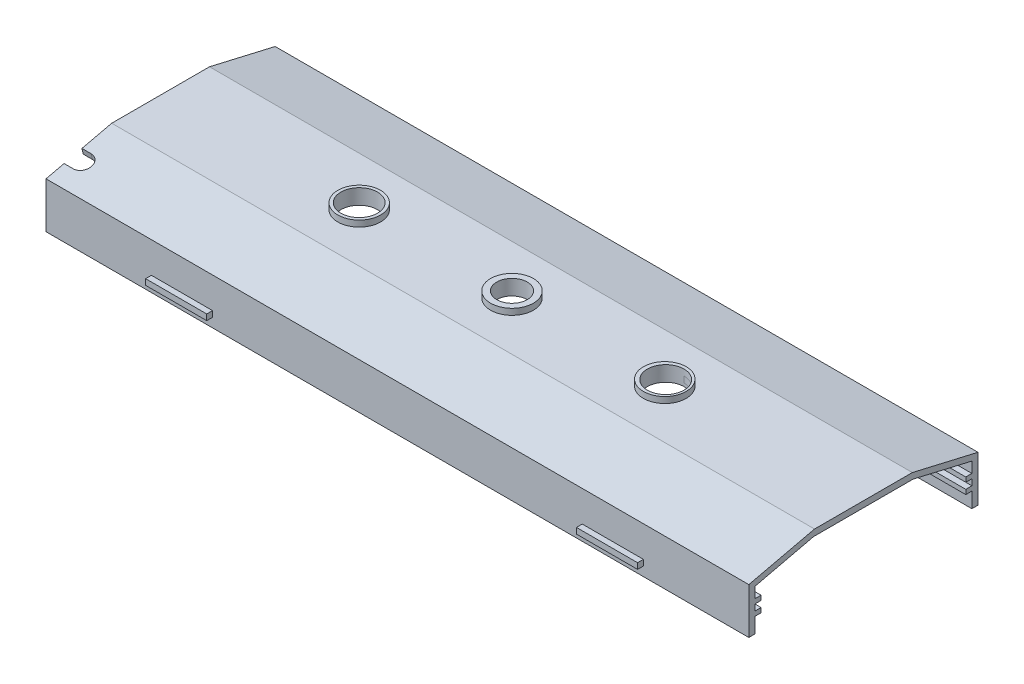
ISO-10303-21;
HEADER;
FILE_DESCRIPTION(('STEP AP214'),'2;1');
FILE_NAME('part.step','',(''),(''),'','','');
FILE_SCHEMA(('AUTOMOTIVE_DESIGN { 1 0 10303 214 1 1 1 1 }'));
ENDSEC;
DATA;
#1=APPLICATION_CONTEXT('core data for automotive mechanical design processes');
#2=APPLICATION_PROTOCOL_DEFINITION('international standard','automotive_design',2000,#1);
#3=PRODUCT_CONTEXT('',#1,'mechanical');
#4=PRODUCT('Part','Part','',(#3));
#5=PRODUCT_RELATED_PRODUCT_CATEGORY('part','',(#4));
#6=PRODUCT_DEFINITION_FORMATION('','',#4);
#7=PRODUCT_DEFINITION_CONTEXT('part definition',#1,'design');
#8=PRODUCT_DEFINITION('design','',#6,#7);
#9=PRODUCT_DEFINITION_SHAPE('','',#8);
#10=(LENGTH_UNIT() NAMED_UNIT(*) SI_UNIT(.MILLI.,.METRE.));
#11=(NAMED_UNIT(*) PLANE_ANGLE_UNIT() SI_UNIT($,.RADIAN.));
#12=(NAMED_UNIT(*) SI_UNIT($,.STERADIAN.) SOLID_ANGLE_UNIT());
#13=UNCERTAINTY_MEASURE_WITH_UNIT(LENGTH_MEASURE(1.E-05),#10,'distance_accuracy_value','');
#14=(GEOMETRIC_REPRESENTATION_CONTEXT(3) GLOBAL_UNCERTAINTY_ASSIGNED_CONTEXT((#13)) GLOBAL_UNIT_ASSIGNED_CONTEXT((#10,
#11,#12)) REPRESENTATION_CONTEXT('',''));
#15=CARTESIAN_POINT('',(0.,0.,0.));
#16=DIRECTION('',(0.,0.,1.));
#17=DIRECTION('',(1.,0.,0.));
#18=AXIS2_PLACEMENT_3D('',#15,#16,#17);
#19=CARTESIAN_POINT('',(230.,15.,-37.5));
#20=DIRECTION('',(0.,0.,1.));
#21=DIRECTION('',(1.,0.,0.));
#22=AXIS2_PLACEMENT_3D('',#19,#20,#21);
#23=PLANE('',#22);
#24=DIRECTION('',(0.,-1.,0.));
#25=VECTOR('',#24,1.);
#26=CARTESIAN_POINT('',(195.5,4.9,-37.5));
#27=LINE('',#26,#25);
#28=CARTESIAN_POINT('',(195.5,4.9,-37.5));
#29=VERTEX_POINT('',#28);
#30=CARTESIAN_POINT('',(195.5,3.,-37.5));
#31=VERTEX_POINT('',#30);
#32=EDGE_CURVE('E378',#29,#31,#27,.T.);
#33=ORIENTED_EDGE('',*,*,#32,.F.);
#34=DIRECTION('',(1.,0.,0.));
#35=VECTOR('',#34,1.);
#36=CARTESIAN_POINT('',(195.5,4.9,-37.5));
#37=LINE('',#36,#35);
#38=CARTESIAN_POINT('',(175.5,4.9,-37.5));
#39=VERTEX_POINT('',#38);
#40=EDGE_CURVE('E387',#39,#29,#37,.T.);
#41=ORIENTED_EDGE('',*,*,#40,.F.);
#42=DIRECTION('',(0.,1.,0.));
#43=VECTOR('',#42,1.);
#44=CARTESIAN_POINT('',(175.5,4.9,-37.5));
#45=LINE('',#44,#43);
#46=CARTESIAN_POINT('',(175.5,3.,-37.5));
#47=VERTEX_POINT('',#46);
#48=EDGE_CURVE('E384',#47,#39,#45,.T.);
#49=ORIENTED_EDGE('',*,*,#48,.F.);
#50=DIRECTION('',(-1.,0.,0.));
#51=VECTOR('',#50,1.);
#52=CARTESIAN_POINT('',(195.5,3.,-37.5));
#53=LINE('',#52,#51);
#54=EDGE_CURVE('E381',#31,#47,#53,.T.);
#55=ORIENTED_EDGE('',*,*,#54,.F.);
#56=EDGE_LOOP('',(#33,#41,#49,#55));
#57=FACE_BOUND('',#56,.T.);
#58=DIRECTION('',(0.,1.,0.));
#59=VECTOR('',#58,1.);
#60=CARTESIAN_POINT('',(0.,15.,-37.5));
#61=LINE('',#60,#59);
#62=CARTESIAN_POINT('',(0.,0.,-37.5));
#63=VERTEX_POINT('',#62);
#64=CARTESIAN_POINT('',(0.,15.,-37.5));
#65=VERTEX_POINT('',#64);
#66=EDGE_CURVE('E593',#63,#65,#61,.T.);
#67=ORIENTED_EDGE('',*,*,#66,.T.);
#68=DIRECTION('',(-1.,0.,0.));
#69=VECTOR('',#68,1.);
#70=CARTESIAN_POINT('',(230.,15.,-37.5));
#71=LINE('',#70,#69);
#72=CARTESIAN_POINT('',(230.,15.,-37.5));
#73=VERTEX_POINT('',#72);
#74=EDGE_CURVE('E674',#73,#65,#71,.T.);
#75=ORIENTED_EDGE('',*,*,#74,.F.);
#76=DIRECTION('',(0.,1.,0.));
#77=VECTOR('',#76,1.);
#78=CARTESIAN_POINT('',(230.,15.,-37.5));
#79=LINE('',#78,#77);
#80=CARTESIAN_POINT('',(230.,0.,-37.5));
#81=VERTEX_POINT('',#80);
#82=EDGE_CURVE('E652',#81,#73,#79,.T.);
#83=ORIENTED_EDGE('',*,*,#82,.F.);
#84=DIRECTION('',(-1.,0.,0.));
#85=VECTOR('',#84,1.);
#86=CARTESIAN_POINT('',(230.,0.,-37.5));
#87=LINE('',#86,#85);
#88=EDGE_CURVE('E677',#81,#63,#87,.T.);
#89=ORIENTED_EDGE('',*,*,#88,.T.);
#90=EDGE_LOOP('',(#67,#75,#83,#89));
#91=FACE_BOUND('',#90,.T.);
#92=DIRECTION('',(0.,-1.,0.));
#93=VECTOR('',#92,1.);
#94=CARTESIAN_POINT('',(54.5,4.9,-37.5));
#95=LINE('',#94,#93);
#96=CARTESIAN_POINT('',(54.5,4.9,-37.5));
#97=VERTEX_POINT('',#96);
#98=CARTESIAN_POINT('',(54.5,3.,-37.5));
#99=VERTEX_POINT('',#98);
#100=EDGE_CURVE('E346',#97,#99,#95,.T.);
#101=ORIENTED_EDGE('',*,*,#100,.F.);
#102=DIRECTION('',(1.,0.,0.));
#103=VECTOR('',#102,1.);
#104=CARTESIAN_POINT('',(54.5,4.9,-37.5));
#105=LINE('',#104,#103);
#106=CARTESIAN_POINT('',(34.5,4.9,-37.5));
#107=VERTEX_POINT('',#106);
#108=EDGE_CURVE('E348',#107,#97,#105,.T.);
#109=ORIENTED_EDGE('',*,*,#108,.F.);
#110=DIRECTION('',(0.,1.,0.));
#111=VECTOR('',#110,1.);
#112=CARTESIAN_POINT('',(34.5,4.9,-37.5));
#113=LINE('',#112,#111);
#114=CARTESIAN_POINT('',(34.5,3.,-37.5));
#115=VERTEX_POINT('',#114);
#116=EDGE_CURVE('E53',#115,#107,#113,.T.);
#117=ORIENTED_EDGE('',*,*,#116,.F.);
#118=DIRECTION('',(-1.,0.,0.));
#119=VECTOR('',#118,1.);
#120=CARTESIAN_POINT('',(54.5,3.,-37.5));
#121=LINE('',#120,#119);
#122=EDGE_CURVE('E48',#99,#115,#121,.T.);
#123=ORIENTED_EDGE('',*,*,#122,.F.);
#124=EDGE_LOOP('',(#101,#109,#117,#123));
#125=FACE_BOUND('',#124,.T.);
#126=ADVANCED_FACE('F33',(#57,#91,#125),#23,.F.);
#127=CARTESIAN_POINT('',(230.,15.,37.5));
#128=DIRECTION('',(0.,0.,-1.));
#129=DIRECTION('',(-1.,0.,0.));
#130=AXIS2_PLACEMENT_3D('',#127,#128,#129);
#131=PLANE('',#130);
#132=DIRECTION('',(0.,-1.,0.));
#133=VECTOR('',#132,1.);
#134=CARTESIAN_POINT('',(34.5,4.9,37.5));
#135=LINE('',#134,#133);
#136=CARTESIAN_POINT('',(34.5,4.9,37.5));
#137=VERTEX_POINT('',#136);
#138=CARTESIAN_POINT('',(34.5,3.,37.5));
#139=VERTEX_POINT('',#138);
#140=EDGE_CURVE('E444',#137,#139,#135,.T.);
#141=ORIENTED_EDGE('',*,*,#140,.F.);
#142=DIRECTION('',(-1.,0.,0.));
#143=VECTOR('',#142,1.);
#144=CARTESIAN_POINT('',(34.5,4.9,37.5));
#145=LINE('',#144,#143);
#146=CARTESIAN_POINT('',(54.5,4.9,37.5));
#147=VERTEX_POINT('',#146);
#148=EDGE_CURVE('E453',#147,#137,#145,.T.);
#149=ORIENTED_EDGE('',*,*,#148,.F.);
#150=DIRECTION('',(0.,1.,0.));
#151=VECTOR('',#150,1.);
#152=CARTESIAN_POINT('',(54.5,4.9,37.5));
#153=LINE('',#152,#151);
#154=CARTESIAN_POINT('',(54.5,3.,37.5));
#155=VERTEX_POINT('',#154);
#156=EDGE_CURVE('E450',#155,#147,#153,.T.);
#157=ORIENTED_EDGE('',*,*,#156,.F.);
#158=DIRECTION('',(1.,0.,0.));
#159=VECTOR('',#158,1.);
#160=CARTESIAN_POINT('',(34.5,3.,37.5));
#161=LINE('',#160,#159);
#162=EDGE_CURVE('E447',#139,#155,#161,.T.);
#163=ORIENTED_EDGE('',*,*,#162,.F.);
#164=EDGE_LOOP('',(#141,#149,#157,#163));
#165=FACE_BOUND('',#164,.T.);
#166=DIRECTION('',(0.,-1.,0.));
#167=VECTOR('',#166,1.);
#168=CARTESIAN_POINT('',(0.,15.,37.5));
#169=LINE('',#168,#167);
#170=CARTESIAN_POINT('',(0.,15.,37.5));
#171=VERTEX_POINT('',#170);
#172=CARTESIAN_POINT('',(0.,0.,37.5));
#173=VERTEX_POINT('',#172);
#174=EDGE_CURVE('E603',#171,#173,#169,.T.);
#175=ORIENTED_EDGE('',*,*,#174,.T.);
#176=DIRECTION('',(-1.,0.,0.));
#177=VECTOR('',#176,1.);
#178=CARTESIAN_POINT('',(230.,0.,37.5));
#179=LINE('',#178,#177);
#180=CARTESIAN_POINT('',(230.,0.,37.5));
#181=VERTEX_POINT('',#180);
#182=EDGE_CURVE('E662',#181,#173,#179,.T.);
#183=ORIENTED_EDGE('',*,*,#182,.F.);
#184=DIRECTION('',(0.,-1.,0.));
#185=VECTOR('',#184,1.);
#186=CARTESIAN_POINT('',(230.,15.,37.5));
#187=LINE('',#186,#185);
#188=CARTESIAN_POINT('',(230.,15.,37.5));
#189=VERTEX_POINT('',#188);
#190=EDGE_CURVE('E660',#189,#181,#187,.T.);
#191=ORIENTED_EDGE('',*,*,#190,.F.);
#192=DIRECTION('',(-1.,0.,0.));
#193=VECTOR('',#192,1.);
#194=CARTESIAN_POINT('',(230.,15.,37.5));
#195=LINE('',#194,#193);
#196=EDGE_CURVE('E665',#189,#171,#195,.T.);
#197=ORIENTED_EDGE('',*,*,#196,.T.);
#198=EDGE_LOOP('',(#175,#183,#191,#197));
#199=FACE_BOUND('',#198,.T.);
#200=DIRECTION('',(0.,-1.,0.));
#201=VECTOR('',#200,1.);
#202=CARTESIAN_POINT('',(175.5,4.9,37.5));
#203=LINE('',#202,#201);
#204=CARTESIAN_POINT('',(175.5,4.9,37.5));
#205=VERTEX_POINT('',#204);
#206=CARTESIAN_POINT('',(175.5,3.,37.5));
#207=VERTEX_POINT('',#206);
#208=EDGE_CURVE('E411',#205,#207,#203,.T.);
#209=ORIENTED_EDGE('',*,*,#208,.F.);
#210=DIRECTION('',(-1.,0.,0.));
#211=VECTOR('',#210,1.);
#212=CARTESIAN_POINT('',(175.5,4.9,37.5));
#213=LINE('',#212,#211);
#214=CARTESIAN_POINT('',(195.5,4.9,37.5));
#215=VERTEX_POINT('',#214);
#216=EDGE_CURVE('E420',#215,#205,#213,.T.);
#217=ORIENTED_EDGE('',*,*,#216,.F.);
#218=DIRECTION('',(0.,1.,0.));
#219=VECTOR('',#218,1.);
#220=CARTESIAN_POINT('',(195.5,4.9,37.5));
#221=LINE('',#220,#219);
#222=CARTESIAN_POINT('',(195.5,3.,37.5));
#223=VERTEX_POINT('',#222);
#224=EDGE_CURVE('E417',#223,#215,#221,.T.);
#225=ORIENTED_EDGE('',*,*,#224,.F.);
#226=DIRECTION('',(1.,0.,0.));
#227=VECTOR('',#226,1.);
#228=CARTESIAN_POINT('',(175.5,3.,37.5));
#229=LINE('',#228,#227);
#230=EDGE_CURVE('E414',#207,#223,#229,.T.);
#231=ORIENTED_EDGE('',*,*,#230,.F.);
#232=EDGE_LOOP('',(#209,#217,#225,#231));
#233=FACE_BOUND('',#232,.T.);
#234=ADVANCED_FACE('F876',(#165,#199,#233),#131,.F.);
#235=CARTESIAN_POINT('',(230.,13.5,35.5));
#236=DIRECTION('',(0.,0.973616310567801,0.228191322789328));
#237=DIRECTION('',(0.,-0.228191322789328,0.973616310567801));
#238=AXIS2_PLACEMENT_3D('',#235,#236,#237);
#239=PLANE('',#238);
#240=DIRECTION('',(1.,0.,0.));
#241=VECTOR('',#240,1.);
#242=CARTESIAN_POINT('',(230.,15.8881385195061,25.3106089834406));
#243=LINE('',#242,#241);
#244=CARTESIAN_POINT('',(0.,15.8881385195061,25.3106089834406));
#245=VERTEX_POINT('',#244);
#246=CARTESIAN_POINT('',(3.,15.8881385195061,25.3106089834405));
#247=VERTEX_POINT('',#246);
#248=EDGE_CURVE('E492',#245,#247,#243,.T.);
#249=ORIENTED_EDGE('',*,*,#248,.F.);
#250=DIRECTION('',(0.,0.228191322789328,-0.973616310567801));
#251=VECTOR('',#250,1.);
#252=CARTESIAN_POINT('',(0.,13.5,35.5));
#253=LINE('',#252,#251);
#254=CARTESIAN_POINT('',(0.,18.,16.3));
#255=VERTEX_POINT('',#254);
#256=EDGE_CURVE('E565',#245,#255,#253,.T.);
#257=ORIENTED_EDGE('',*,*,#256,.T.);
#258=DIRECTION('',(-1.,0.,0.));
#259=VECTOR('',#258,1.);
#260=CARTESIAN_POINT('',(230.,18.,16.3));
#261=LINE('',#260,#259);
#262=CARTESIAN_POINT('',(230.,18.,16.3));
#263=VERTEX_POINT('',#262);
#264=EDGE_CURVE('E713',#263,#255,#261,.T.);
#265=ORIENTED_EDGE('',*,*,#264,.F.);
#266=DIRECTION('',(0.,0.228191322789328,-0.973616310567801));
#267=VECTOR('',#266,1.);
#268=CARTESIAN_POINT('',(230.,13.5,35.5));
#269=LINE('',#268,#267);
#270=CARTESIAN_POINT('',(230.,13.5,35.5));
#271=VERTEX_POINT('',#270);
#272=EDGE_CURVE('E626',#271,#263,#269,.T.);
#273=ORIENTED_EDGE('',*,*,#272,.F.);
#274=DIRECTION('',(-1.,0.,0.));
#275=VECTOR('',#274,1.);
#276=CARTESIAN_POINT('',(230.,13.5,35.5));
#277=LINE('',#276,#275);
#278=CARTESIAN_POINT('',(0.,13.5,35.5));
#279=VERTEX_POINT('',#278);
#280=EDGE_CURVE('E716',#271,#279,#277,.T.);
#281=ORIENTED_EDGE('',*,*,#280,.T.);
#282=CARTESIAN_POINT('',(0.,14.5189885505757,31.1523155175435));
#283=VERTEX_POINT('',#282);
#284=EDGE_CURVE('E566',#279,#283,#253,.T.);
#285=ORIENTED_EDGE('',*,*,#284,.T.);
#286=DIRECTION('',(-1.,0.,0.));
#287=VECTOR('',#286,1.);
#288=CARTESIAN_POINT('',(230.,14.5189885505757,31.1523155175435));
#289=LINE('',#288,#287);
#290=CARTESIAN_POINT('',(3.,14.5189885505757,31.1523155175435));
#291=VERTEX_POINT('',#290);
#292=EDGE_CURVE('E486',#291,#283,#289,.T.);
#293=ORIENTED_EDGE('',*,*,#292,.F.);
#294=CARTESIAN_POINT('',(3.,15.2035635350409,28.231462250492));
#295=DIRECTION('',(0.,0.973616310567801,0.228191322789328));
#296=DIRECTION('',(0.,-0.228191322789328,0.973616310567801));
#297=AXIS2_PLACEMENT_3D('',#294,#295,#296);
#298=ELLIPSE('',#297,3.00000445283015,3.);
#299=EDGE_CURVE('E495',#247,#291,#298,.F.);
#300=ORIENTED_EDGE('',*,*,#299,.F.);
#301=EDGE_LOOP('',(#249,#257,#265,#273,#281,#285,#293,#300));
#302=FACE_BOUND('',#301,.T.);
#303=ADVANCED_FACE('F865',(#302),#239,.F.);
#304=CARTESIAN_POINT('',(230.,20.,16.));
#305=DIRECTION('',(0.,-0.974008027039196,-0.226513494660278));
#306=DIRECTION('',(0.,0.226513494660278,-0.974008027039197));
#307=AXIS2_PLACEMENT_3D('',#304,#305,#306);
#308=PLANE('',#307);
#309=DIRECTION('',(-1.,0.,0.));
#310=VECTOR('',#309,1.);
#311=CARTESIAN_POINT('',(230.,17.7348650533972,25.740080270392));
#312=LINE('',#311,#310);
#313=CARTESIAN_POINT('',(3.,17.7348650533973,25.740080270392));
#314=VERTEX_POINT('',#313);
#315=CARTESIAN_POINT('',(0.,17.7348650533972,25.740080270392));
#316=VERTEX_POINT('',#315);
#317=EDGE_CURVE('E489',#314,#316,#312,.T.);
#318=ORIENTED_EDGE('',*,*,#317,.F.);
#319=CARTESIAN_POINT('',(3.,17.0553245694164,28.6621043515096));
#320=DIRECTION('',(0.,-0.974008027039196,-0.226513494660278));
#321=DIRECTION('',(0.,0.226513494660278,-0.974008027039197));
#322=AXIS2_PLACEMENT_3D('',#319,#320,#321);
#323=CIRCLE('',#322,3.);
#324=CARTESIAN_POINT('',(3.,16.3757840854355,31.5841284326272));
#325=VERTEX_POINT('',#324);
#326=EDGE_CURVE('E11',#325,#314,#323,.F.);
#327=ORIENTED_EDGE('',*,*,#326,.F.);
#328=DIRECTION('',(1.,0.,0.));
#329=VECTOR('',#328,1.);
#330=CARTESIAN_POINT('',(230.,16.3757840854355,31.5841284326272));
#331=LINE('',#330,#329);
#332=CARTESIAN_POINT('',(0.,16.3757840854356,31.5841284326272));
#333=VERTEX_POINT('',#332);
#334=EDGE_CURVE('E483',#333,#325,#331,.T.);
#335=ORIENTED_EDGE('',*,*,#334,.F.);
#336=DIRECTION('',(0.,-0.226513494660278,0.974008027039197));
#337=VECTOR('',#336,1.);
#338=CARTESIAN_POINT('',(0.,20.,16.));
#339=LINE('',#338,#337);
#340=EDGE_CURVE('E599',#333,#171,#339,.T.);
#341=ORIENTED_EDGE('',*,*,#340,.T.);
#342=ORIENTED_EDGE('',*,*,#196,.F.);
#343=DIRECTION('',(0.,-0.226513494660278,0.974008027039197));
#344=VECTOR('',#343,1.);
#345=CARTESIAN_POINT('',(230.,20.,16.));
#346=LINE('',#345,#344);
#347=CARTESIAN_POINT('',(230.,20.,16.));
#348=VERTEX_POINT('',#347);
#349=EDGE_CURVE('E658',#348,#189,#346,.T.);
#350=ORIENTED_EDGE('',*,*,#349,.F.);
#351=DIRECTION('',(-1.,0.,0.));
#352=VECTOR('',#351,1.);
#353=CARTESIAN_POINT('',(230.,20.,16.));
#354=LINE('',#353,#352);
#355=CARTESIAN_POINT('',(0.,20.,16.));
#356=VERTEX_POINT('',#355);
#357=EDGE_CURVE('E668',#348,#356,#354,.T.);
#358=ORIENTED_EDGE('',*,*,#357,.T.);
#359=EDGE_CURVE('E600',#356,#316,#339,.T.);
#360=ORIENTED_EDGE('',*,*,#359,.T.);
#361=EDGE_LOOP('',(#318,#327,#335,#341,#342,#350,#358,#360));
#362=FACE_BOUND('',#361,.T.);
#363=ADVANCED_FACE('F785',(#362),#308,.F.);
#364=CARTESIAN_POINT('',(0.,0.,35.5));
#365=DIRECTION('',(1.,0.,0.));
#366=DIRECTION('',(0.,0.,-1.));
#367=AXIS2_PLACEMENT_3D('',#364,#365,#366);
#368=PLANE('',#367);
#369=DIRECTION('',(0.,-0.974008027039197,-0.226513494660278));
#370=VECTOR('',#369,1.);
#371=CARTESIAN_POINT('',(0.,3.06323857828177,22.3280741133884));
#372=LINE('',#371,#370);
#373=EDGE_CURVE('E41',#316,#245,#372,.T.);
#374=ORIENTED_EDGE('',*,*,#373,.F.);
#375=ORIENTED_EDGE('',*,*,#359,.F.);
#376=DIRECTION('',(0.,0.,1.));
#377=VECTOR('',#376,1.);
#378=CARTESIAN_POINT('',(0.,20.,-16.));
#379=LINE('',#378,#377);
#380=CARTESIAN_POINT('',(0.,20.,-16.));
#381=VERTEX_POINT('',#380);
#382=EDGE_CURVE('E597',#381,#356,#379,.T.);
#383=ORIENTED_EDGE('',*,*,#382,.F.);
#384=DIRECTION('',(0.,0.226513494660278,0.974008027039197));
#385=VECTOR('',#384,1.);
#386=CARTESIAN_POINT('',(0.,20.,-16.));
#387=LINE('',#386,#385);
#388=EDGE_CURVE('E595',#65,#381,#387,.T.);
#389=ORIENTED_EDGE('',*,*,#388,.F.);
#390=ORIENTED_EDGE('',*,*,#66,.F.);
#391=DIRECTION('',(0.,0.,-1.));
#392=VECTOR('',#391,1.);
#393=CARTESIAN_POINT('',(0.,0.,-37.5));
#394=LINE('',#393,#392);
#395=CARTESIAN_POINT('',(0.,0.,-35.5));
#396=VERTEX_POINT('',#395);
#397=EDGE_CURVE('E591',#396,#63,#394,.T.);
#398=ORIENTED_EDGE('',*,*,#397,.F.);
#399=DIRECTION('',(0.,-1.,0.));
#400=VECTOR('',#399,1.);
#401=CARTESIAN_POINT('',(0.,0.,-35.5));
#402=LINE('',#401,#400);
#403=CARTESIAN_POINT('',(0.,5.,-35.5));
#404=VERTEX_POINT('',#403);
#405=EDGE_CURVE('E589',#404,#396,#402,.T.);
#406=ORIENTED_EDGE('',*,*,#405,.F.);
#407=DIRECTION('',(0.,0.,-1.));
#408=VECTOR('',#407,1.);
#409=CARTESIAN_POINT('',(0.,5.,-35.5));
#410=LINE('',#409,#408);
#411=CARTESIAN_POINT('',(0.,5.,-33.5));
#412=VERTEX_POINT('',#411);
#413=EDGE_CURVE('E587',#412,#404,#410,.T.);
#414=ORIENTED_EDGE('',*,*,#413,.F.);
#415=DIRECTION('',(0.,-1.,0.));
#416=VECTOR('',#415,1.);
#417=CARTESIAN_POINT('',(0.,5.,-33.5));
#418=LINE('',#417,#416);
#419=CARTESIAN_POINT('',(0.,6.5,-33.5));
#420=VERTEX_POINT('',#419);
#421=EDGE_CURVE('E585',#420,#412,#418,.T.);
#422=ORIENTED_EDGE('',*,*,#421,.F.);
#423=DIRECTION('',(0.,0.,1.));
#424=VECTOR('',#423,1.);
#425=CARTESIAN_POINT('',(0.,6.5,-33.5));
#426=LINE('',#425,#424);
#427=CARTESIAN_POINT('',(0.,6.5,-35.5));
#428=VERTEX_POINT('',#427);
#429=EDGE_CURVE('E583',#428,#420,#426,.T.);
#430=ORIENTED_EDGE('',*,*,#429,.F.);
#431=DIRECTION('',(0.,-1.,0.));
#432=VECTOR('',#431,1.);
#433=CARTESIAN_POINT('',(0.,6.5,-35.5));
#434=LINE('',#433,#432);
#435=CARTESIAN_POINT('',(0.,8.5,-35.5));
#436=VERTEX_POINT('',#435);
#437=EDGE_CURVE('E581',#436,#428,#434,.T.);
#438=ORIENTED_EDGE('',*,*,#437,.F.);
#439=DIRECTION('',(0.,0.,-1.));
#440=VECTOR('',#439,1.);
#441=CARTESIAN_POINT('',(0.,8.5,-35.5));
#442=LINE('',#441,#440);
#443=CARTESIAN_POINT('',(0.,8.5,-33.5));
#444=VERTEX_POINT('',#443);
#445=EDGE_CURVE('E579',#444,#436,#442,.T.);
#446=ORIENTED_EDGE('',*,*,#445,.F.);
#447=DIRECTION('',(0.,-1.,0.));
#448=VECTOR('',#447,1.);
#449=CARTESIAN_POINT('',(0.,8.5,-33.5));
#450=LINE('',#449,#448);
#451=CARTESIAN_POINT('',(0.,10.,-33.5));
#452=VERTEX_POINT('',#451);
#453=EDGE_CURVE('E577',#452,#444,#450,.T.);
#454=ORIENTED_EDGE('',*,*,#453,.F.);
#455=DIRECTION('',(0.,0.,1.));
#456=VECTOR('',#455,1.);
#457=CARTESIAN_POINT('',(0.,10.,-33.5));
#458=LINE('',#457,#456);
#459=CARTESIAN_POINT('',(0.,10.,-35.5));
#460=VERTEX_POINT('',#459);
#461=EDGE_CURVE('E575',#460,#452,#458,.T.);
#462=ORIENTED_EDGE('',*,*,#461,.F.);
#463=DIRECTION('',(0.,-1.,0.));
#464=VECTOR('',#463,1.);
#465=CARTESIAN_POINT('',(0.,10.,-35.5));
#466=LINE('',#465,#464);
#467=CARTESIAN_POINT('',(0.,13.5,-35.5));
#468=VERTEX_POINT('',#467);
#469=EDGE_CURVE('E573',#468,#460,#466,.T.);
#470=ORIENTED_EDGE('',*,*,#469,.F.);
#471=DIRECTION('',(0.,-0.228191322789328,-0.973616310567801));
#472=VECTOR('',#471,1.);
#473=CARTESIAN_POINT('',(0.,13.5,-35.5));
#474=LINE('',#473,#472);
#475=CARTESIAN_POINT('',(0.,18.,-16.3));
#476=VERTEX_POINT('',#475);
#477=EDGE_CURVE('E571',#476,#468,#474,.T.);
#478=ORIENTED_EDGE('',*,*,#477,.F.);
#479=DIRECTION('',(0.,0.,-1.));
#480=VECTOR('',#479,1.);
#481=CARTESIAN_POINT('',(0.,18.,16.3));
#482=LINE('',#481,#480);
#483=EDGE_CURVE('E569',#255,#476,#482,.T.);
#484=ORIENTED_EDGE('',*,*,#483,.F.);
#485=ORIENTED_EDGE('',*,*,#256,.F.);
#486=EDGE_LOOP('',(#374,#375,#383,#389,#390,#398,#406,#414,#422,#430,#438,#446,#454,#462,#470,
#478,#484,#485));
#487=FACE_BOUND('',#486,.T.);
#488=ADVANCED_FACE('F781',(#487),#368,.F.);
#489=DIRECTION('',(0.,0.974008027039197,0.226513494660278));
#490=VECTOR('',#489,1.);
#491=CARTESIAN_POINT('',(0.,1.7041576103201,28.1721222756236));
#492=LINE('',#491,#490);
#493=EDGE_CURVE('E772',#283,#333,#492,.T.);
#494=ORIENTED_EDGE('',*,*,#493,.F.);
#495=ORIENTED_EDGE('',*,*,#284,.F.);
#496=DIRECTION('',(0.,1.,0.));
#497=VECTOR('',#496,1.);
#498=CARTESIAN_POINT('',(0.,10.,35.5));
#499=LINE('',#498,#497);
#500=CARTESIAN_POINT('',(0.,10.,35.5));
#501=VERTEX_POINT('',#500);
#502=EDGE_CURVE('E563',#501,#279,#499,.T.);
#503=ORIENTED_EDGE('',*,*,#502,.F.);
#504=DIRECTION('',(0.,0.,1.));
#505=VECTOR('',#504,1.);
#506=CARTESIAN_POINT('',(0.,10.,33.5));
#507=LINE('',#506,#505);
#508=CARTESIAN_POINT('',(0.,10.,33.5));
#509=VERTEX_POINT('',#508);
#510=EDGE_CURVE('E561',#509,#501,#507,.T.);
#511=ORIENTED_EDGE('',*,*,#510,.F.);
#512=DIRECTION('',(0.,1.,0.));
#513=VECTOR('',#512,1.);
#514=CARTESIAN_POINT('',(0.,8.5,33.5));
#515=LINE('',#514,#513);
#516=CARTESIAN_POINT('',(0.,8.5,33.5));
#517=VERTEX_POINT('',#516);
#518=EDGE_CURVE('E559',#517,#509,#515,.T.);
#519=ORIENTED_EDGE('',*,*,#518,.F.);
#520=DIRECTION('',(0.,0.,-1.));
#521=VECTOR('',#520,1.);
#522=CARTESIAN_POINT('',(0.,8.5,35.5));
#523=LINE('',#522,#521);
#524=CARTESIAN_POINT('',(0.,8.5,35.5));
#525=VERTEX_POINT('',#524);
#526=EDGE_CURVE('E557',#525,#517,#523,.T.);
#527=ORIENTED_EDGE('',*,*,#526,.F.);
#528=DIRECTION('',(0.,1.,0.));
#529=VECTOR('',#528,1.);
#530=CARTESIAN_POINT('',(0.,6.5,35.5));
#531=LINE('',#530,#529);
#532=CARTESIAN_POINT('',(0.,6.5,35.5));
#533=VERTEX_POINT('',#532);
#534=EDGE_CURVE('E555',#533,#525,#531,.T.);
#535=ORIENTED_EDGE('',*,*,#534,.F.);
#536=DIRECTION('',(0.,0.,1.));
#537=VECTOR('',#536,1.);
#538=CARTESIAN_POINT('',(0.,6.5,33.5));
#539=LINE('',#538,#537);
#540=CARTESIAN_POINT('',(0.,6.5,33.5));
#541=VERTEX_POINT('',#540);
#542=EDGE_CURVE('E553',#541,#533,#539,.T.);
#543=ORIENTED_EDGE('',*,*,#542,.F.);
#544=DIRECTION('',(0.,1.,0.));
#545=VECTOR('',#544,1.);
#546=CARTESIAN_POINT('',(0.,5.,33.5));
#547=LINE('',#546,#545);
#548=CARTESIAN_POINT('',(0.,5.,33.5));
#549=VERTEX_POINT('',#548);
#550=EDGE_CURVE('E551',#549,#541,#547,.T.);
#551=ORIENTED_EDGE('',*,*,#550,.F.);
#552=DIRECTION('',(0.,0.,-1.));
#553=VECTOR('',#552,1.);
#554=CARTESIAN_POINT('',(0.,5.,35.5));
#555=LINE('',#554,#553);
#556=CARTESIAN_POINT('',(0.,5.,35.5));
#557=VERTEX_POINT('',#556);
#558=EDGE_CURVE('E549',#557,#549,#555,.T.);
#559=ORIENTED_EDGE('',*,*,#558,.F.);
#560=DIRECTION('',(0.,1.,0.));
#561=VECTOR('',#560,1.);
#562=CARTESIAN_POINT('',(0.,0.,35.5));
#563=LINE('',#562,#561);
#564=CARTESIAN_POINT('',(0.,0.,35.5));
#565=VERTEX_POINT('',#564);
#566=EDGE_CURVE('E547',#565,#557,#563,.T.);
#567=ORIENTED_EDGE('',*,*,#566,.F.);
#568=DIRECTION('',(0.,0.,-1.));
#569=VECTOR('',#568,1.);
#570=CARTESIAN_POINT('',(0.,0.,37.5));
#571=LINE('',#570,#569);
#572=EDGE_CURVE('E544',#173,#565,#571,.T.);
#573=ORIENTED_EDGE('',*,*,#572,.F.);
#574=ORIENTED_EDGE('',*,*,#174,.F.);
#575=ORIENTED_EDGE('',*,*,#340,.F.);
#576=EDGE_LOOP('',(#494,#495,#503,#511,#519,#527,#535,#543,#551,#559,#567,#573,#574,#575));
#577=FACE_BOUND('',#576,.T.);
#578=ADVANCED_FACE('F880',(#577),#368,.F.);
#579=CARTESIAN_POINT('',(230.,18.,16.3));
#580=DIRECTION('',(0.,1.,0.));
#581=DIRECTION('',(0.,0.,1.));
#582=AXIS2_PLACEMENT_3D('',#579,#580,#581);
#583=PLANE('',#582);
#584=CARTESIAN_POINT('',(65.,18.,0.));
#585=DIRECTION('',(0.,1.,0.));
#586=DIRECTION('',(0.,0.,1.));
#587=AXIS2_PLACEMENT_3D('',#584,#585,#586);
#588=CIRCLE('',#587,8.00000000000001);
#589=CARTESIAN_POINT('',(65.,18.,8.00000000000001));
#590=VERTEX_POINT('',#589);
#591=EDGE_CURVE('E763',#590,#590,#588,.F.);
#592=ORIENTED_EDGE('',*,*,#591,.F.);
#593=EDGE_LOOP('',(#592));
#594=FACE_BOUND('',#593,.T.);
#595=ORIENTED_EDGE('',*,*,#483,.T.);
#596=DIRECTION('',(-1.,0.,0.));
#597=VECTOR('',#596,1.);
#598=CARTESIAN_POINT('',(230.,18.,-16.3));
#599=LINE('',#598,#597);
#600=CARTESIAN_POINT('',(230.,18.,-16.3));
#601=VERTEX_POINT('',#600);
#602=EDGE_CURVE('E710',#601,#476,#599,.T.);
#603=ORIENTED_EDGE('',*,*,#602,.F.);
#604=DIRECTION('',(0.,0.,-1.));
#605=VECTOR('',#604,1.);
#606=CARTESIAN_POINT('',(230.,18.,16.3));
#607=LINE('',#606,#605);
#608=EDGE_CURVE('E628',#263,#601,#607,.T.);
#609=ORIENTED_EDGE('',*,*,#608,.F.);
#610=ORIENTED_EDGE('',*,*,#264,.T.);
#611=EDGE_LOOP('',(#595,#603,#609,#610));
#612=FACE_BOUND('',#611,.T.);
#613=CARTESIAN_POINT('',(165.907368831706,18.,0.));
#614=DIRECTION('',(0.,1.,0.));
#615=DIRECTION('',(0.,0.,1.));
#616=AXIS2_PLACEMENT_3D('',#613,#614,#615);
#617=CIRCLE('',#616,8.00000000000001);
#618=CARTESIAN_POINT('',(165.907368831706,18.,8.00000000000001));
#619=VERTEX_POINT('',#618);
#620=EDGE_CURVE('E749',#619,#619,#617,.F.);
#621=ORIENTED_EDGE('',*,*,#620,.F.);
#622=EDGE_LOOP('',(#621));
#623=FACE_BOUND('',#622,.T.);
#624=CARTESIAN_POINT('',(115.,18.,0.));
#625=DIRECTION('',(0.,1.,0.));
#626=DIRECTION('',(0.,0.,1.));
#627=AXIS2_PLACEMENT_3D('',#624,#625,#626);
#628=CIRCLE('',#627,8.00000000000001);
#629=CARTESIAN_POINT('',(115.,18.,8.00000000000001));
#630=VERTEX_POINT('',#629);
#631=EDGE_CURVE('E769',#630,#630,#628,.F.);
#632=ORIENTED_EDGE('',*,*,#631,.F.);
#633=EDGE_LOOP('',(#632));
#634=FACE_BOUND('',#633,.T.);
#635=ADVANCED_FACE('F860',(#594,#612,#623,#634),#583,.F.);
#636=CARTESIAN_POINT('',(230.,20.,-16.));
#637=DIRECTION('',(0.,-1.,0.));
#638=DIRECTION('',(0.,0.,-1.));
#639=AXIS2_PLACEMENT_3D('',#636,#637,#638);
#640=PLANE('',#639);
#641=CARTESIAN_POINT('',(65.,20.,0.));
#642=DIRECTION('',(0.,-1.,0.));
#643=DIRECTION('',(0.,0.,-1.));
#644=AXIS2_PLACEMENT_3D('',#641,#642,#643);
#645=CIRCLE('',#644,7.);
#646=CARTESIAN_POINT('',(65.,20.,-7.));
#647=VERTEX_POINT('',#646);
#648=EDGE_CURVE('E760',#647,#647,#645,.F.);
#649=ORIENTED_EDGE('',*,*,#648,.F.);
#650=EDGE_LOOP('',(#649));
#651=FACE_BOUND('',#650,.T.);
#652=ORIENTED_EDGE('',*,*,#382,.T.);
#653=ORIENTED_EDGE('',*,*,#357,.F.);
#654=DIRECTION('',(0.,0.,1.));
#655=VECTOR('',#654,1.);
#656=CARTESIAN_POINT('',(230.,20.,-16.));
#657=LINE('',#656,#655);
#658=CARTESIAN_POINT('',(230.,20.,-16.));
#659=VERTEX_POINT('',#658);
#660=EDGE_CURVE('E656',#659,#348,#657,.T.);
#661=ORIENTED_EDGE('',*,*,#660,.F.);
#662=DIRECTION('',(-1.,0.,0.));
#663=VECTOR('',#662,1.);
#664=CARTESIAN_POINT('',(230.,20.,-16.));
#665=LINE('',#664,#663);
#666=EDGE_CURVE('E671',#659,#381,#665,.T.);
#667=ORIENTED_EDGE('',*,*,#666,.T.);
#668=EDGE_LOOP('',(#652,#653,#661,#667));
#669=FACE_BOUND('',#668,.T.);
#670=CARTESIAN_POINT('',(165.,20.,0.));
#671=DIRECTION('',(0.,-1.,0.));
#672=DIRECTION('',(0.,0.,-1.));
#673=AXIS2_PLACEMENT_3D('',#670,#671,#672);
#674=CIRCLE('',#673,7.00000000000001);
#675=CARTESIAN_POINT('',(165.,20.,-7.00000000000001));
#676=VERTEX_POINT('',#675);
#677=EDGE_CURVE('E746',#676,#676,#674,.F.);
#678=ORIENTED_EDGE('',*,*,#677,.F.);
#679=EDGE_LOOP('',(#678));
#680=FACE_BOUND('',#679,.T.);
#681=CARTESIAN_POINT('',(115.,20.,0.));
#682=DIRECTION('',(0.,-1.,0.));
#683=DIRECTION('',(0.,0.,-1.));
#684=AXIS2_PLACEMENT_3D('',#681,#682,#683);
#685=CIRCLE('',#684,7.);
#686=CARTESIAN_POINT('',(115.,20.,-7.));
#687=VERTEX_POINT('',#686);
#688=EDGE_CURVE('E766',#687,#687,#685,.F.);
#689=ORIENTED_EDGE('',*,*,#688,.F.);
#690=EDGE_LOOP('',(#689));
#691=FACE_BOUND('',#690,.T.);
#692=ADVANCED_FACE('F791',(#651,#669,#680,#691),#640,.F.);
#693=CARTESIAN_POINT('',(230.,0.,37.5));
#694=DIRECTION('',(0.,1.,0.));
#695=DIRECTION('',(0.,0.,1.));
#696=AXIS2_PLACEMENT_3D('',#693,#694,#695);
#697=PLANE('',#696);
#698=ORIENTED_EDGE('',*,*,#572,.T.);
#699=DIRECTION('',(-1.,0.,0.));
#700=VECTOR('',#699,1.);
#701=CARTESIAN_POINT('',(230.,0.,35.5));
#702=LINE('',#701,#700);
#703=CARTESIAN_POINT('',(230.,0.,35.5));
#704=VERTEX_POINT('',#703);
#705=EDGE_CURVE('E743',#704,#565,#702,.T.);
#706=ORIENTED_EDGE('',*,*,#705,.F.);
#707=DIRECTION('',(0.,0.,-1.));
#708=VECTOR('',#707,1.);
#709=CARTESIAN_POINT('',(230.,0.,37.5));
#710=LINE('',#709,#708);
#711=EDGE_CURVE('E605',#181,#704,#710,.T.);
#712=ORIENTED_EDGE('',*,*,#711,.F.);
#713=ORIENTED_EDGE('',*,*,#182,.T.);
#714=EDGE_LOOP('',(#698,#706,#712,#713));
#715=FACE_BOUND('',#714,.T.);
#716=ADVANCED_FACE('F35',(#715),#697,.F.);
#717=CARTESIAN_POINT('',(230.,0.,35.5));
#718=DIRECTION('',(0.,0.,1.));
#719=DIRECTION('',(1.,0.,0.));
#720=AXIS2_PLACEMENT_3D('',#717,#718,#719);
#721=PLANE('',#720);
#722=ORIENTED_EDGE('',*,*,#566,.T.);
#723=DIRECTION('',(-1.,0.,0.));
#724=VECTOR('',#723,1.);
#725=CARTESIAN_POINT('',(230.,5.,35.5));
#726=LINE('',#725,#724);
#727=CARTESIAN_POINT('',(230.,5.,35.5));
#728=VERTEX_POINT('',#727);
#729=EDGE_CURVE('E740',#728,#557,#726,.T.);
#730=ORIENTED_EDGE('',*,*,#729,.F.);
#731=DIRECTION('',(0.,1.,0.));
#732=VECTOR('',#731,1.);
#733=CARTESIAN_POINT('',(230.,0.,35.5));
#734=LINE('',#733,#732);
#735=EDGE_CURVE('E608',#704,#728,#734,.T.);
#736=ORIENTED_EDGE('',*,*,#735,.F.);
#737=ORIENTED_EDGE('',*,*,#705,.T.);
#738=EDGE_LOOP('',(#722,#730,#736,#737));
#739=FACE_BOUND('',#738,.T.);
#740=ADVANCED_FACE('F929',(#739),#721,.F.);
#741=CARTESIAN_POINT('',(230.,5.,35.5));
#742=DIRECTION('',(0.,1.,0.));
#743=DIRECTION('',(0.,0.,1.));
#744=AXIS2_PLACEMENT_3D('',#741,#742,#743);
#745=PLANE('',#744);
#746=ORIENTED_EDGE('',*,*,#558,.T.);
#747=DIRECTION('',(-1.,0.,0.));
#748=VECTOR('',#747,1.);
#749=CARTESIAN_POINT('',(230.,5.,33.5));
#750=LINE('',#749,#748);
#751=CARTESIAN_POINT('',(230.,5.,33.5));
#752=VERTEX_POINT('',#751);
#753=EDGE_CURVE('E737',#752,#549,#750,.T.);
#754=ORIENTED_EDGE('',*,*,#753,.F.);
#755=DIRECTION('',(0.,0.,-1.));
#756=VECTOR('',#755,1.);
#757=CARTESIAN_POINT('',(230.,5.,35.5));
#758=LINE('',#757,#756);
#759=EDGE_CURVE('E610',#728,#752,#758,.T.);
#760=ORIENTED_EDGE('',*,*,#759,.F.);
#761=ORIENTED_EDGE('',*,*,#729,.T.);
#762=EDGE_LOOP('',(#746,#754,#760,#761));
#763=FACE_BOUND('',#762,.T.);
#764=ADVANCED_FACE('F926',(#763),#745,.F.);
#765=CARTESIAN_POINT('',(230.,5.,33.5));
#766=DIRECTION('',(0.,0.,1.));
#767=DIRECTION('',(1.,0.,0.));
#768=AXIS2_PLACEMENT_3D('',#765,#766,#767);
#769=PLANE('',#768);
#770=ORIENTED_EDGE('',*,*,#550,.T.);
#771=DIRECTION('',(-1.,0.,0.));
#772=VECTOR('',#771,1.);
#773=CARTESIAN_POINT('',(230.,6.5,33.5));
#774=LINE('',#773,#772);
#775=CARTESIAN_POINT('',(230.,6.5,33.5));
#776=VERTEX_POINT('',#775);
#777=EDGE_CURVE('E734',#776,#541,#774,.T.);
#778=ORIENTED_EDGE('',*,*,#777,.F.);
#779=DIRECTION('',(0.,1.,0.));
#780=VECTOR('',#779,1.);
#781=CARTESIAN_POINT('',(230.,5.,33.5));
#782=LINE('',#781,#780);
#783=EDGE_CURVE('E612',#752,#776,#782,.T.);
#784=ORIENTED_EDGE('',*,*,#783,.F.);
#785=ORIENTED_EDGE('',*,*,#753,.T.);
#786=EDGE_LOOP('',(#770,#778,#784,#785));
#787=FACE_BOUND('',#786,.T.);
#788=ADVANCED_FACE('F923',(#787),#769,.F.);
#789=CARTESIAN_POINT('',(230.,6.5,33.5));
#790=DIRECTION('',(0.,-1.,0.));
#791=DIRECTION('',(0.,0.,-1.));
#792=AXIS2_PLACEMENT_3D('',#789,#790,#791);
#793=PLANE('',#792);
#794=ORIENTED_EDGE('',*,*,#542,.T.);
#795=DIRECTION('',(-1.,0.,0.));
#796=VECTOR('',#795,1.);
#797=CARTESIAN_POINT('',(230.,6.5,35.5));
#798=LINE('',#797,#796);
#799=CARTESIAN_POINT('',(230.,6.5,35.5));
#800=VERTEX_POINT('',#799);
#801=EDGE_CURVE('E731',#800,#533,#798,.T.);
#802=ORIENTED_EDGE('',*,*,#801,.F.);
#803=DIRECTION('',(0.,0.,1.));
#804=VECTOR('',#803,1.);
#805=CARTESIAN_POINT('',(230.,6.5,33.5));
#806=LINE('',#805,#804);
#807=EDGE_CURVE('E614',#776,#800,#806,.T.);
#808=ORIENTED_EDGE('',*,*,#807,.F.);
#809=ORIENTED_EDGE('',*,*,#777,.T.);
#810=EDGE_LOOP('',(#794,#802,#808,#809));
#811=FACE_BOUND('',#810,.T.);
#812=ADVANCED_FACE('F919',(#811),#793,.F.);
#813=CARTESIAN_POINT('',(230.,6.5,35.5));
#814=DIRECTION('',(0.,0.,1.));
#815=DIRECTION('',(1.,0.,0.));
#816=AXIS2_PLACEMENT_3D('',#813,#814,#815);
#817=PLANE('',#816);
#818=ORIENTED_EDGE('',*,*,#534,.T.);
#819=DIRECTION('',(-1.,0.,0.));
#820=VECTOR('',#819,1.);
#821=CARTESIAN_POINT('',(230.,8.5,35.5));
#822=LINE('',#821,#820);
#823=CARTESIAN_POINT('',(230.,8.5,35.5));
#824=VERTEX_POINT('',#823);
#825=EDGE_CURVE('E728',#824,#525,#822,.T.);
#826=ORIENTED_EDGE('',*,*,#825,.F.);
#827=DIRECTION('',(0.,1.,0.));
#828=VECTOR('',#827,1.);
#829=CARTESIAN_POINT('',(230.,6.5,35.5));
#830=LINE('',#829,#828);
#831=EDGE_CURVE('E616',#800,#824,#830,.T.);
#832=ORIENTED_EDGE('',*,*,#831,.F.);
#833=ORIENTED_EDGE('',*,*,#801,.T.);
#834=EDGE_LOOP('',(#818,#826,#832,#833));
#835=FACE_BOUND('',#834,.T.);
#836=ADVANCED_FACE('F914',(#835),#817,.F.);
#837=CARTESIAN_POINT('',(230.,8.5,35.5));
#838=DIRECTION('',(0.,1.,0.));
#839=DIRECTION('',(0.,0.,1.));
#840=AXIS2_PLACEMENT_3D('',#837,#838,#839);
#841=PLANE('',#840);
#842=ORIENTED_EDGE('',*,*,#526,.T.);
#843=DIRECTION('',(-1.,0.,0.));
#844=VECTOR('',#843,1.);
#845=CARTESIAN_POINT('',(230.,8.5,33.5));
#846=LINE('',#845,#844);
#847=CARTESIAN_POINT('',(230.,8.5,33.5));
#848=VERTEX_POINT('',#847);
#849=EDGE_CURVE('E725',#848,#517,#846,.T.);
#850=ORIENTED_EDGE('',*,*,#849,.F.);
#851=DIRECTION('',(0.,0.,-1.));
#852=VECTOR('',#851,1.);
#853=CARTESIAN_POINT('',(230.,8.5,35.5));
#854=LINE('',#853,#852);
#855=EDGE_CURVE('E618',#824,#848,#854,.T.);
#856=ORIENTED_EDGE('',*,*,#855,.F.);
#857=ORIENTED_EDGE('',*,*,#825,.T.);
#858=EDGE_LOOP('',(#842,#850,#856,#857));
#859=FACE_BOUND('',#858,.T.);
#860=ADVANCED_FACE('F908',(#859),#841,.F.);
#861=CARTESIAN_POINT('',(230.,8.5,33.5));
#862=DIRECTION('',(0.,0.,1.));
#863=DIRECTION('',(1.,0.,0.));
#864=AXIS2_PLACEMENT_3D('',#861,#862,#863);
#865=PLANE('',#864);
#866=ORIENTED_EDGE('',*,*,#518,.T.);
#867=DIRECTION('',(-1.,0.,0.));
#868=VECTOR('',#867,1.);
#869=CARTESIAN_POINT('',(230.,10.,33.5));
#870=LINE('',#869,#868);
#871=CARTESIAN_POINT('',(230.,10.,33.5));
#872=VERTEX_POINT('',#871);
#873=EDGE_CURVE('E722',#872,#509,#870,.T.);
#874=ORIENTED_EDGE('',*,*,#873,.F.);
#875=DIRECTION('',(0.,1.,0.));
#876=VECTOR('',#875,1.);
#877=CARTESIAN_POINT('',(230.,8.5,33.5));
#878=LINE('',#877,#876);
#879=EDGE_CURVE('E620',#848,#872,#878,.T.);
#880=ORIENTED_EDGE('',*,*,#879,.F.);
#881=ORIENTED_EDGE('',*,*,#849,.T.);
#882=EDGE_LOOP('',(#866,#874,#880,#881));
#883=FACE_BOUND('',#882,.T.);
#884=ADVANCED_FACE('F904',(#883),#865,.F.);
#885=CARTESIAN_POINT('',(230.,10.,33.5));
#886=DIRECTION('',(0.,-1.,0.));
#887=DIRECTION('',(0.,0.,-1.));
#888=AXIS2_PLACEMENT_3D('',#885,#886,#887);
#889=PLANE('',#888);
#890=ORIENTED_EDGE('',*,*,#510,.T.);
#891=DIRECTION('',(-1.,0.,0.));
#892=VECTOR('',#891,1.);
#893=CARTESIAN_POINT('',(230.,10.,35.5));
#894=LINE('',#893,#892);
#895=CARTESIAN_POINT('',(230.,10.,35.5));
#896=VERTEX_POINT('',#895);
#897=EDGE_CURVE('E719',#896,#501,#894,.T.);
#898=ORIENTED_EDGE('',*,*,#897,.F.);
#899=DIRECTION('',(0.,0.,1.));
#900=VECTOR('',#899,1.);
#901=CARTESIAN_POINT('',(230.,10.,33.5));
#902=LINE('',#901,#900);
#903=EDGE_CURVE('E622',#872,#896,#902,.T.);
#904=ORIENTED_EDGE('',*,*,#903,.F.);
#905=ORIENTED_EDGE('',*,*,#873,.T.);
#906=EDGE_LOOP('',(#890,#898,#904,#905));
#907=FACE_BOUND('',#906,.T.);
#908=ADVANCED_FACE('F900',(#907),#889,.F.);
#909=CARTESIAN_POINT('',(230.,10.,35.5));
#910=DIRECTION('',(0.,0.,1.));
#911=DIRECTION('',(1.,0.,0.));
#912=AXIS2_PLACEMENT_3D('',#909,#910,#911);
#913=PLANE('',#912);
#914=ORIENTED_EDGE('',*,*,#502,.T.);
#915=ORIENTED_EDGE('',*,*,#280,.F.);
#916=DIRECTION('',(0.,1.,0.));
#917=VECTOR('',#916,1.);
#918=CARTESIAN_POINT('',(230.,10.,35.5));
#919=LINE('',#918,#917);
#920=EDGE_CURVE('E624',#896,#271,#919,.T.);
#921=ORIENTED_EDGE('',*,*,#920,.F.);
#922=ORIENTED_EDGE('',*,*,#897,.T.);
#923=EDGE_LOOP('',(#914,#915,#921,#922));
#924=FACE_BOUND('',#923,.T.);
#925=ADVANCED_FACE('F893',(#924),#913,.F.);
#926=CARTESIAN_POINT('',(230.,13.5,-35.5));
#927=DIRECTION('',(0.,0.973616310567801,-0.228191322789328));
#928=DIRECTION('',(0.,0.228191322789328,0.973616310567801));
#929=AXIS2_PLACEMENT_3D('',#926,#927,#928);
#930=PLANE('',#929);
#931=ORIENTED_EDGE('',*,*,#477,.T.);
#932=DIRECTION('',(-1.,0.,0.));
#933=VECTOR('',#932,1.);
#934=CARTESIAN_POINT('',(230.,13.5,-35.5));
#935=LINE('',#934,#933);
#936=CARTESIAN_POINT('',(230.,13.5,-35.5));
#937=VERTEX_POINT('',#936);
#938=EDGE_CURVE('E707',#937,#468,#935,.T.);
#939=ORIENTED_EDGE('',*,*,#938,.F.);
#940=DIRECTION('',(0.,-0.228191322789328,-0.973616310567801));
#941=VECTOR('',#940,1.);
#942=CARTESIAN_POINT('',(230.,13.5,-35.5));
#943=LINE('',#942,#941);
#944=EDGE_CURVE('E630',#601,#937,#943,.T.);
#945=ORIENTED_EDGE('',*,*,#944,.F.);
#946=ORIENTED_EDGE('',*,*,#602,.T.);
#947=EDGE_LOOP('',(#931,#939,#945,#946));
#948=FACE_BOUND('',#947,.T.);
#949=ADVANCED_FACE('F855',(#948),#930,.F.);
#950=CARTESIAN_POINT('',(230.,10.,-35.5));
#951=DIRECTION('',(0.,0.,-1.));
#952=DIRECTION('',(-1.,0.,0.));
#953=AXIS2_PLACEMENT_3D('',#950,#951,#952);
#954=PLANE('',#953);
#955=ORIENTED_EDGE('',*,*,#469,.T.);
#956=DIRECTION('',(-1.,0.,0.));
#957=VECTOR('',#956,1.);
#958=CARTESIAN_POINT('',(230.,10.,-35.5));
#959=LINE('',#958,#957);
#960=CARTESIAN_POINT('',(230.,10.,-35.5));
#961=VERTEX_POINT('',#960);
#962=EDGE_CURVE('E704',#961,#460,#959,.T.);
#963=ORIENTED_EDGE('',*,*,#962,.F.);
#964=DIRECTION('',(0.,-1.,0.));
#965=VECTOR('',#964,1.);
#966=CARTESIAN_POINT('',(230.,10.,-35.5));
#967=LINE('',#966,#965);
#968=EDGE_CURVE('E632',#937,#961,#967,.T.);
#969=ORIENTED_EDGE('',*,*,#968,.F.);
#970=ORIENTED_EDGE('',*,*,#938,.T.);
#971=EDGE_LOOP('',(#955,#963,#969,#970));
#972=FACE_BOUND('',#971,.T.);
#973=ADVANCED_FACE('F851',(#972),#954,.F.);
#974=CARTESIAN_POINT('',(230.,10.,-33.5));
#975=DIRECTION('',(0.,-1.,0.));
#976=DIRECTION('',(0.,0.,-1.));
#977=AXIS2_PLACEMENT_3D('',#974,#975,#976);
#978=PLANE('',#977);
#979=ORIENTED_EDGE('',*,*,#461,.T.);
#980=DIRECTION('',(-1.,0.,0.));
#981=VECTOR('',#980,1.);
#982=CARTESIAN_POINT('',(230.,10.,-33.5));
#983=LINE('',#982,#981);
#984=CARTESIAN_POINT('',(230.,10.,-33.5));
#985=VERTEX_POINT('',#984);
#986=EDGE_CURVE('E701',#985,#452,#983,.T.);
#987=ORIENTED_EDGE('',*,*,#986,.F.);
#988=DIRECTION('',(0.,0.,1.));
#989=VECTOR('',#988,1.);
#990=CARTESIAN_POINT('',(230.,10.,-33.5));
#991=LINE('',#990,#989);
#992=EDGE_CURVE('E634',#961,#985,#991,.T.);
#993=ORIENTED_EDGE('',*,*,#992,.F.);
#994=ORIENTED_EDGE('',*,*,#962,.T.);
#995=EDGE_LOOP('',(#979,#987,#993,#994));
#996=FACE_BOUND('',#995,.T.);
#997=ADVANCED_FACE('F847',(#996),#978,.F.);
#998=CARTESIAN_POINT('',(230.,8.5,-33.5));
#999=DIRECTION('',(0.,0.,-1.));
#1000=DIRECTION('',(-1.,0.,0.));
#1001=AXIS2_PLACEMENT_3D('',#998,#999,#1000);
#1002=PLANE('',#1001);
#1003=ORIENTED_EDGE('',*,*,#453,.T.);
#1004=DIRECTION('',(-1.,0.,0.));
#1005=VECTOR('',#1004,1.);
#1006=CARTESIAN_POINT('',(230.,8.5,-33.5));
#1007=LINE('',#1006,#1005);
#1008=CARTESIAN_POINT('',(230.,8.5,-33.5));
#1009=VERTEX_POINT('',#1008);
#1010=EDGE_CURVE('E698',#1009,#444,#1007,.T.);
#1011=ORIENTED_EDGE('',*,*,#1010,.F.);
#1012=DIRECTION('',(0.,-1.,0.));
#1013=VECTOR('',#1012,1.);
#1014=CARTESIAN_POINT('',(230.,8.5,-33.5));
#1015=LINE('',#1014,#1013);
#1016=EDGE_CURVE('E636',#985,#1009,#1015,.T.);
#1017=ORIENTED_EDGE('',*,*,#1016,.F.);
#1018=ORIENTED_EDGE('',*,*,#986,.T.);
#1019=EDGE_LOOP('',(#1003,#1011,#1017,#1018));
#1020=FACE_BOUND('',#1019,.T.);
#1021=ADVANCED_FACE('F842',(#1020),#1002,.F.);
#1022=CARTESIAN_POINT('',(230.,8.5,-35.5));
#1023=DIRECTION('',(0.,1.,0.));
#1024=DIRECTION('',(0.,0.,1.));
#1025=AXIS2_PLACEMENT_3D('',#1022,#1023,#1024);
#1026=PLANE('',#1025);
#1027=ORIENTED_EDGE('',*,*,#445,.T.);
#1028=DIRECTION('',(-1.,0.,0.));
#1029=VECTOR('',#1028,1.);
#1030=CARTESIAN_POINT('',(230.,8.5,-35.5));
#1031=LINE('',#1030,#1029);
#1032=CARTESIAN_POINT('',(230.,8.5,-35.5));
#1033=VERTEX_POINT('',#1032);
#1034=EDGE_CURVE('E695',#1033,#436,#1031,.T.);
#1035=ORIENTED_EDGE('',*,*,#1034,.F.);
#1036=DIRECTION('',(0.,0.,-1.));
#1037=VECTOR('',#1036,1.);
#1038=CARTESIAN_POINT('',(230.,8.5,-35.5));
#1039=LINE('',#1038,#1037);
#1040=EDGE_CURVE('E638',#1009,#1033,#1039,.T.);
#1041=ORIENTED_EDGE('',*,*,#1040,.F.);
#1042=ORIENTED_EDGE('',*,*,#1010,.T.);
#1043=EDGE_LOOP('',(#1027,#1035,#1041,#1042));
#1044=FACE_BOUND('',#1043,.T.);
#1045=ADVANCED_FACE('F836',(#1044),#1026,.F.);
#1046=CARTESIAN_POINT('',(230.,6.5,-35.5));
#1047=DIRECTION('',(0.,0.,-1.));
#1048=DIRECTION('',(-1.,0.,0.));
#1049=AXIS2_PLACEMENT_3D('',#1046,#1047,#1048);
#1050=PLANE('',#1049);
#1051=ORIENTED_EDGE('',*,*,#437,.T.);
#1052=DIRECTION('',(-1.,0.,0.));
#1053=VECTOR('',#1052,1.);
#1054=CARTESIAN_POINT('',(230.,6.5,-35.5));
#1055=LINE('',#1054,#1053);
#1056=CARTESIAN_POINT('',(230.,6.5,-35.5));
#1057=VERTEX_POINT('',#1056);
#1058=EDGE_CURVE('E692',#1057,#428,#1055,.T.);
#1059=ORIENTED_EDGE('',*,*,#1058,.F.);
#1060=DIRECTION('',(0.,-1.,0.));
#1061=VECTOR('',#1060,1.);
#1062=CARTESIAN_POINT('',(230.,6.5,-35.5));
#1063=LINE('',#1062,#1061);
#1064=EDGE_CURVE('E640',#1033,#1057,#1063,.T.);
#1065=ORIENTED_EDGE('',*,*,#1064,.F.);
#1066=ORIENTED_EDGE('',*,*,#1034,.T.);
#1067=EDGE_LOOP('',(#1051,#1059,#1065,#1066));
#1068=FACE_BOUND('',#1067,.T.);
#1069=ADVANCED_FACE('F832',(#1068),#1050,.F.);
#1070=CARTESIAN_POINT('',(230.,6.5,-33.5));
#1071=DIRECTION('',(0.,-1.,0.));
#1072=DIRECTION('',(0.,0.,-1.));
#1073=AXIS2_PLACEMENT_3D('',#1070,#1071,#1072);
#1074=PLANE('',#1073);
#1075=ORIENTED_EDGE('',*,*,#429,.T.);
#1076=DIRECTION('',(-1.,0.,0.));
#1077=VECTOR('',#1076,1.);
#1078=CARTESIAN_POINT('',(230.,6.5,-33.5));
#1079=LINE('',#1078,#1077);
#1080=CARTESIAN_POINT('',(230.,6.5,-33.5));
#1081=VERTEX_POINT('',#1080);
#1082=EDGE_CURVE('E689',#1081,#420,#1079,.T.);
#1083=ORIENTED_EDGE('',*,*,#1082,.F.);
#1084=DIRECTION('',(0.,0.,1.));
#1085=VECTOR('',#1084,1.);
#1086=CARTESIAN_POINT('',(230.,6.5,-33.5));
#1087=LINE('',#1086,#1085);
#1088=EDGE_CURVE('E642',#1057,#1081,#1087,.T.);
#1089=ORIENTED_EDGE('',*,*,#1088,.F.);
#1090=ORIENTED_EDGE('',*,*,#1058,.T.);
#1091=EDGE_LOOP('',(#1075,#1083,#1089,#1090));
#1092=FACE_BOUND('',#1091,.T.);
#1093=ADVANCED_FACE('F827',(#1092),#1074,.F.);
#1094=CARTESIAN_POINT('',(230.,5.,-33.5));
#1095=DIRECTION('',(0.,0.,-1.));
#1096=DIRECTION('',(-1.,0.,0.));
#1097=AXIS2_PLACEMENT_3D('',#1094,#1095,#1096);
#1098=PLANE('',#1097);
#1099=ORIENTED_EDGE('',*,*,#421,.T.);
#1100=DIRECTION('',(-1.,0.,0.));
#1101=VECTOR('',#1100,1.);
#1102=CARTESIAN_POINT('',(230.,5.,-33.5));
#1103=LINE('',#1102,#1101);
#1104=CARTESIAN_POINT('',(230.,5.,-33.5));
#1105=VERTEX_POINT('',#1104);
#1106=EDGE_CURVE('E686',#1105,#412,#1103,.T.);
#1107=ORIENTED_EDGE('',*,*,#1106,.F.);
#1108=DIRECTION('',(0.,-1.,0.));
#1109=VECTOR('',#1108,1.);
#1110=CARTESIAN_POINT('',(230.,5.,-33.5));
#1111=LINE('',#1110,#1109);
#1112=EDGE_CURVE('E644',#1081,#1105,#1111,.T.);
#1113=ORIENTED_EDGE('',*,*,#1112,.F.);
#1114=ORIENTED_EDGE('',*,*,#1082,.T.);
#1115=EDGE_LOOP('',(#1099,#1107,#1113,#1114));
#1116=FACE_BOUND('',#1115,.T.);
#1117=ADVANCED_FACE('F821',(#1116),#1098,.F.);
#1118=CARTESIAN_POINT('',(230.,5.,-35.5));
#1119=DIRECTION('',(0.,1.,0.));
#1120=DIRECTION('',(0.,0.,1.));
#1121=AXIS2_PLACEMENT_3D('',#1118,#1119,#1120);
#1122=PLANE('',#1121);
#1123=ORIENTED_EDGE('',*,*,#413,.T.);
#1124=DIRECTION('',(-1.,0.,0.));
#1125=VECTOR('',#1124,1.);
#1126=CARTESIAN_POINT('',(230.,5.,-35.5));
#1127=LINE('',#1126,#1125);
#1128=CARTESIAN_POINT('',(230.,5.,-35.5));
#1129=VERTEX_POINT('',#1128);
#1130=EDGE_CURVE('E683',#1129,#404,#1127,.T.);
#1131=ORIENTED_EDGE('',*,*,#1130,.F.);
#1132=DIRECTION('',(0.,0.,-1.));
#1133=VECTOR('',#1132,1.);
#1134=CARTESIAN_POINT('',(230.,5.,-35.5));
#1135=LINE('',#1134,#1133);
#1136=EDGE_CURVE('E646',#1105,#1129,#1135,.T.);
#1137=ORIENTED_EDGE('',*,*,#1136,.F.);
#1138=ORIENTED_EDGE('',*,*,#1106,.T.);
#1139=EDGE_LOOP('',(#1123,#1131,#1137,#1138));
#1140=FACE_BOUND('',#1139,.T.);
#1141=ADVANCED_FACE('F817',(#1140),#1122,.F.);
#1142=CARTESIAN_POINT('',(230.,0.,-35.5));
#1143=DIRECTION('',(0.,0.,-1.));
#1144=DIRECTION('',(-1.,0.,0.));
#1145=AXIS2_PLACEMENT_3D('',#1142,#1143,#1144);
#1146=PLANE('',#1145);
#1147=ORIENTED_EDGE('',*,*,#405,.T.);
#1148=DIRECTION('',(-1.,0.,0.));
#1149=VECTOR('',#1148,1.);
#1150=CARTESIAN_POINT('',(230.,0.,-35.5));
#1151=LINE('',#1150,#1149);
#1152=CARTESIAN_POINT('',(230.,0.,-35.5));
#1153=VERTEX_POINT('',#1152);
#1154=EDGE_CURVE('E680',#1153,#396,#1151,.T.);
#1155=ORIENTED_EDGE('',*,*,#1154,.F.);
#1156=DIRECTION('',(0.,-1.,0.));
#1157=VECTOR('',#1156,1.);
#1158=CARTESIAN_POINT('',(230.,0.,-35.5));
#1159=LINE('',#1158,#1157);
#1160=EDGE_CURVE('E648',#1129,#1153,#1159,.T.);
#1161=ORIENTED_EDGE('',*,*,#1160,.F.);
#1162=ORIENTED_EDGE('',*,*,#1130,.T.);
#1163=EDGE_LOOP('',(#1147,#1155,#1161,#1162));
#1164=FACE_BOUND('',#1163,.T.);
#1165=ADVANCED_FACE('F812',(#1164),#1146,.F.);
#1166=CARTESIAN_POINT('',(230.,0.,-37.5));
#1167=DIRECTION('',(0.,1.,0.));
#1168=DIRECTION('',(0.,0.,1.));
#1169=AXIS2_PLACEMENT_3D('',#1166,#1167,#1168);
#1170=PLANE('',#1169);
#1171=ORIENTED_EDGE('',*,*,#397,.T.);
#1172=ORIENTED_EDGE('',*,*,#88,.F.);
#1173=DIRECTION('',(0.,0.,-1.));
#1174=VECTOR('',#1173,1.);
#1175=CARTESIAN_POINT('',(230.,0.,-37.5));
#1176=LINE('',#1175,#1174);
#1177=EDGE_CURVE('E650',#1153,#81,#1176,.T.);
#1178=ORIENTED_EDGE('',*,*,#1177,.F.);
#1179=ORIENTED_EDGE('',*,*,#1154,.T.);
#1180=EDGE_LOOP('',(#1171,#1172,#1178,#1179));
#1181=FACE_BOUND('',#1180,.T.);
#1182=ADVANCED_FACE('F806',(#1181),#1170,.F.);
#1183=CARTESIAN_POINT('',(230.,20.,-16.));
#1184=DIRECTION('',(0.,-0.974008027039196,0.226513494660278));
#1185=DIRECTION('',(0.,-0.226513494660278,-0.974008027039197));
#1186=AXIS2_PLACEMENT_3D('',#1183,#1184,#1185);
#1187=PLANE('',#1186);
#1188=ORIENTED_EDGE('',*,*,#388,.T.);
#1189=ORIENTED_EDGE('',*,*,#666,.F.);
#1190=DIRECTION('',(0.,0.226513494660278,0.974008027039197));
#1191=VECTOR('',#1190,1.);
#1192=CARTESIAN_POINT('',(230.,20.,-16.));
#1193=LINE('',#1192,#1191);
#1194=EDGE_CURVE('E654',#73,#659,#1193,.T.);
#1195=ORIENTED_EDGE('',*,*,#1194,.F.);
#1196=ORIENTED_EDGE('',*,*,#74,.T.);
#1197=EDGE_LOOP('',(#1188,#1189,#1195,#1196));
#1198=FACE_BOUND('',#1197,.T.);
#1199=ADVANCED_FACE('F798',(#1198),#1187,.F.);
#1200=CARTESIAN_POINT('',(230.,0.,35.5));
#1201=DIRECTION('',(1.,0.,0.));
#1202=DIRECTION('',(0.,0.,-1.));
#1203=AXIS2_PLACEMENT_3D('',#1200,#1201,#1202);
#1204=PLANE('',#1203);
#1205=ORIENTED_EDGE('',*,*,#711,.T.);
#1206=ORIENTED_EDGE('',*,*,#735,.T.);
#1207=ORIENTED_EDGE('',*,*,#759,.T.);
#1208=ORIENTED_EDGE('',*,*,#783,.T.);
#1209=ORIENTED_EDGE('',*,*,#807,.T.);
#1210=ORIENTED_EDGE('',*,*,#831,.T.);
#1211=ORIENTED_EDGE('',*,*,#855,.T.);
#1212=ORIENTED_EDGE('',*,*,#879,.T.);
#1213=ORIENTED_EDGE('',*,*,#903,.T.);
#1214=ORIENTED_EDGE('',*,*,#920,.T.);
#1215=ORIENTED_EDGE('',*,*,#272,.T.);
#1216=ORIENTED_EDGE('',*,*,#608,.T.);
#1217=ORIENTED_EDGE('',*,*,#944,.T.);
#1218=ORIENTED_EDGE('',*,*,#968,.T.);
#1219=ORIENTED_EDGE('',*,*,#992,.T.);
#1220=ORIENTED_EDGE('',*,*,#1016,.T.);
#1221=ORIENTED_EDGE('',*,*,#1040,.T.);
#1222=ORIENTED_EDGE('',*,*,#1064,.T.);
#1223=ORIENTED_EDGE('',*,*,#1088,.T.);
#1224=ORIENTED_EDGE('',*,*,#1112,.T.);
#1225=ORIENTED_EDGE('',*,*,#1136,.T.);
#1226=ORIENTED_EDGE('',*,*,#1160,.T.);
#1227=ORIENTED_EDGE('',*,*,#1177,.T.);
#1228=ORIENTED_EDGE('',*,*,#82,.T.);
#1229=ORIENTED_EDGE('',*,*,#1194,.T.);
#1230=ORIENTED_EDGE('',*,*,#660,.T.);
#1231=ORIENTED_EDGE('',*,*,#349,.T.);
#1232=ORIENTED_EDGE('',*,*,#190,.T.);
#1233=EDGE_LOOP('',(#1205,#1206,#1207,#1208,#1209,#1210,#1211,#1212,#1213,#1214,#1215,#1216,
#1217,#1218,#1219,#1220,#1221,#1222,#1223,#1224,#1225,#1226,#1227,#1228,#1229,#1230,#1231,#1232));
#1234=FACE_BOUND('',#1233,.T.);
#1235=ADVANCED_FACE('F886',(#1234),#1204,.T.);
#1236=CARTESIAN_POINT('',(165.,22.,0.));
#1237=DIRECTION('',(0.,-1.,0.));
#1238=DIRECTION('',(0.,0.,-1.));
#1239=AXIS2_PLACEMENT_3D('',#1236,#1237,#1238);
#1240=CYLINDRICAL_SURFACE('',#1239,7.00000000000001);
#1241=CARTESIAN_POINT('',(165.,22.,0.));
#1242=DIRECTION('',(0.,1.,0.));
#1243=DIRECTION('',(0.,0.,1.));
#1244=AXIS2_PLACEMENT_3D('',#1241,#1242,#1243);
#1245=CIRCLE('',#1244,7.00000000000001);
#1246=CARTESIAN_POINT('',(165.,22.,7.00000000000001));
#1247=VERTEX_POINT('',#1246);
#1248=EDGE_CURVE('E541',#1247,#1247,#1245,.T.);
#1249=ORIENTED_EDGE('',*,*,#1248,.F.);
#1250=EDGE_LOOP('',(#1249));
#1251=FACE_BOUND('',#1250,.T.);
#1252=ORIENTED_EDGE('',*,*,#677,.T.);
#1253=EDGE_LOOP('',(#1252));
#1254=FACE_BOUND('',#1253,.T.);
#1255=ADVANCED_FACE('F1070',(#1251,#1254),#1240,.T.);
#1256=CARTESIAN_POINT('',(165.,22.,0.));
#1257=DIRECTION('',(0.,1.,0.));
#1258=DIRECTION('',(0.,0.,1.));
#1259=AXIS2_PLACEMENT_3D('',#1256,#1257,#1258);
#1260=PLANE('',#1259);
#1261=CARTESIAN_POINT('',(165.302253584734,22.,0.));
#1262=DIRECTION('',(0.,1.,0.));
#1263=DIRECTION('',(0.,0.,1.));
#1264=AXIS2_PLACEMENT_3D('',#1261,#1262,#1263);
#1265=CIRCLE('',#1264,6.00000000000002);
#1266=CARTESIAN_POINT('',(165.302253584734,22.,6.00000000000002));
#1267=VERTEX_POINT('',#1266);
#1268=EDGE_CURVE('E522',#1267,#1267,#1265,.T.);
#1269=ORIENTED_EDGE('',*,*,#1268,.F.);
#1270=EDGE_LOOP('',(#1269));
#1271=FACE_BOUND('',#1270,.T.);
#1272=ORIENTED_EDGE('',*,*,#1248,.T.);
#1273=EDGE_LOOP('',(#1272));
#1274=FACE_BOUND('',#1273,.T.);
#1275=ADVANCED_FACE('F1077',(#1271,#1274),#1260,.T.);
#1276=CARTESIAN_POINT('',(165.907368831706,17.,0.));
#1277=DIRECTION('',(0.,1.,0.));
#1278=DIRECTION('',(0.,0.,1.));
#1279=AXIS2_PLACEMENT_3D('',#1276,#1277,#1278);
#1280=CYLINDRICAL_SURFACE('',#1279,8.00000000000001);
#1281=CARTESIAN_POINT('',(165.907368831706,17.,0.));
#1282=DIRECTION('',(0.,-1.,0.));
#1283=DIRECTION('',(0.,0.,-1.));
#1284=AXIS2_PLACEMENT_3D('',#1281,#1282,#1283);
#1285=CIRCLE('',#1284,8.00000000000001);
#1286=CARTESIAN_POINT('',(165.907368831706,17.,-8.00000000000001));
#1287=VERTEX_POINT('',#1286);
#1288=EDGE_CURVE('E534',#1287,#1287,#1285,.T.);
#1289=ORIENTED_EDGE('',*,*,#1288,.F.);
#1290=EDGE_LOOP('',(#1289));
#1291=FACE_BOUND('',#1290,.T.);
#1292=ORIENTED_EDGE('',*,*,#620,.T.);
#1293=EDGE_LOOP('',(#1292));
#1294=FACE_BOUND('',#1293,.T.);
#1295=ADVANCED_FACE('F1086',(#1291,#1294),#1280,.T.);
#1296=CARTESIAN_POINT('',(165.907368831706,17.,0.));
#1297=DIRECTION('',(0.,-1.,0.));
#1298=DIRECTION('',(0.,0.,-1.));
#1299=AXIS2_PLACEMENT_3D('',#1296,#1297,#1298);
#1300=PLANE('',#1299);
#1301=CARTESIAN_POINT('',(165.302253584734,17.,0.));
#1302=DIRECTION('',(0.,-1.,0.));
#1303=DIRECTION('',(0.,0.,-1.));
#1304=AXIS2_PLACEMENT_3D('',#1301,#1302,#1303);
#1305=CIRCLE('',#1304,6.00000000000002);
#1306=CARTESIAN_POINT('',(165.302253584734,17.,-6.00000000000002));
#1307=VERTEX_POINT('',#1306);
#1308=EDGE_CURVE('E531',#1307,#1307,#1305,.T.);
#1309=ORIENTED_EDGE('',*,*,#1308,.F.);
#1310=EDGE_LOOP('',(#1309));
#1311=FACE_BOUND('',#1310,.T.);
#1312=ORIENTED_EDGE('',*,*,#1288,.T.);
#1313=EDGE_LOOP('',(#1312));
#1314=FACE_BOUND('',#1313,.T.);
#1315=ADVANCED_FACE('F1094',(#1311,#1314),#1300,.T.);
#1316=CARTESIAN_POINT('',(165.302253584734,0.,0.));
#1317=DIRECTION('',(0.,1.,0.));
#1318=DIRECTION('',(0.,0.,1.));
#1319=AXIS2_PLACEMENT_3D('',#1316,#1317,#1318);
#1320=CYLINDRICAL_SURFACE('',#1319,6.00000000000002);
#1321=ORIENTED_EDGE('',*,*,#1308,.T.);
#1322=EDGE_LOOP('',(#1321));
#1323=FACE_BOUND('',#1322,.T.);
#1324=ORIENTED_EDGE('',*,*,#1268,.T.);
#1325=EDGE_LOOP('',(#1324));
#1326=FACE_BOUND('',#1325,.T.);
#1327=CARTESIAN_POINT('',(165.302253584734,18.,0.));
#1328=DIRECTION('',(0.,-1.,0.));
#1329=DIRECTION('',(0.,0.,-1.));
#1330=AXIS2_PLACEMENT_3D('',#1327,#1328,#1329);
#1331=CIRCLE('',#1330,6.00000000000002);
#1332=CARTESIAN_POINT('',(165.314525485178,18.,-5.99998745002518));
#1333=VERTEX_POINT('',#1332);
#1334=CARTESIAN_POINT('',(165.314525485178,18.,5.99998745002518));
#1335=VERTEX_POINT('',#1334);
#1336=EDGE_CURVE('E528',#1333,#1335,#1331,.T.);
#1337=ORIENTED_EDGE('',*,*,#1336,.F.);
#1338=DIRECTION('',(0.,1.,0.));
#1339=VECTOR('',#1338,1.);
#1340=CARTESIAN_POINT('',(165.314525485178,11.,-5.99998745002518));
#1341=LINE('',#1340,#1339);
#1342=CARTESIAN_POINT('',(165.314525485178,20.,-5.99998745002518));
#1343=VERTEX_POINT('',#1342);
#1344=EDGE_CURVE('E754',#1343,#1333,#1341,.F.);
#1345=ORIENTED_EDGE('',*,*,#1344,.F.);
#1346=CARTESIAN_POINT('',(165.302253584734,20.,0.));
#1347=DIRECTION('',(0.,1.,0.));
#1348=DIRECTION('',(0.,0.,1.));
#1349=AXIS2_PLACEMENT_3D('',#1346,#1347,#1348);
#1350=CIRCLE('',#1349,6.00000000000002);
#1351=CARTESIAN_POINT('',(165.314525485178,20.,5.99998745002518));
#1352=VERTEX_POINT('',#1351);
#1353=EDGE_CURVE('E525',#1352,#1343,#1350,.T.);
#1354=ORIENTED_EDGE('',*,*,#1353,.F.);
#1355=DIRECTION('',(0.,1.,0.));
#1356=VECTOR('',#1355,1.);
#1357=CARTESIAN_POINT('',(165.314525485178,11.,5.99998745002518));
#1358=LINE('',#1357,#1356);
#1359=EDGE_CURVE('E757',#1335,#1352,#1358,.T.);
#1360=ORIENTED_EDGE('',*,*,#1359,.F.);
#1361=EDGE_LOOP('',(#1337,#1345,#1354,#1360));
#1362=FACE_BOUND('',#1361,.T.);
#1363=ADVANCED_FACE('F1101',(#1323,#1326,#1362),#1320,.F.);
#1364=CARTESIAN_POINT('',(165.907368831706,18.,0.));
#1365=DIRECTION('',(0.,-1.,0.));
#1366=DIRECTION('',(0.,0.,-1.));
#1367=AXIS2_PLACEMENT_3D('',#1364,#1365,#1366);
#1368=PLANE('',#1367);
#1369=CARTESIAN_POINT('',(165.326797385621,18.,0.));
#1370=DIRECTION('',(0.,1.,0.));
#1371=DIRECTION('',(0.,0.,1.));
#1372=AXIS2_PLACEMENT_3D('',#1369,#1370,#1371);
#1373=CIRCLE('',#1372,6.00000000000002);
#1374=EDGE_CURVE('E540',#1335,#1333,#1373,.T.);
#1375=ORIENTED_EDGE('',*,*,#1374,.T.);
#1376=ORIENTED_EDGE('',*,*,#1336,.T.);
#1377=EDGE_LOOP('',(#1375,#1376));
#1378=FACE_BOUND('',#1377,.T.);
#1379=ADVANCED_FACE('F1109',(#1378),#1368,.F.);
#1380=CARTESIAN_POINT('',(165.326797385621,20.,0.));
#1381=DIRECTION('',(0.,1.,0.));
#1382=DIRECTION('',(0.,0.,1.));
#1383=AXIS2_PLACEMENT_3D('',#1380,#1381,#1382);
#1384=PLANE('',#1383);
#1385=CARTESIAN_POINT('',(165.326797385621,20.,0.));
#1386=DIRECTION('',(0.,1.,0.));
#1387=DIRECTION('',(0.,0.,1.));
#1388=AXIS2_PLACEMENT_3D('',#1385,#1386,#1387);
#1389=CIRCLE('',#1388,6.00000000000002);
#1390=EDGE_CURVE('E537',#1352,#1343,#1389,.T.);
#1391=ORIENTED_EDGE('',*,*,#1390,.F.);
#1392=ORIENTED_EDGE('',*,*,#1353,.T.);
#1393=EDGE_LOOP('',(#1391,#1392));
#1394=FACE_BOUND('',#1393,.T.);
#1395=ADVANCED_FACE('F1117',(#1394),#1384,.F.);
#1396=CARTESIAN_POINT('',(165.326797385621,0.,0.));
#1397=DIRECTION('',(0.,1.,0.));
#1398=DIRECTION('',(0.,0.,1.));
#1399=AXIS2_PLACEMENT_3D('',#1396,#1397,#1398);
#1400=CYLINDRICAL_SURFACE('',#1399,6.00000000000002);
#1401=ORIENTED_EDGE('',*,*,#1374,.F.);
#1402=ORIENTED_EDGE('',*,*,#1359,.T.);
#1403=ORIENTED_EDGE('',*,*,#1390,.T.);
#1404=ORIENTED_EDGE('',*,*,#1344,.T.);
#1405=EDGE_LOOP('',(#1401,#1402,#1403,#1404));
#1406=FACE_BOUND('',#1405,.T.);
#1407=ADVANCED_FACE('F1125',(#1406),#1400,.F.);
#1408=CARTESIAN_POINT('',(65.,22.,0.));
#1409=DIRECTION('',(0.,-1.,0.));
#1410=DIRECTION('',(0.,0.,-1.));
#1411=AXIS2_PLACEMENT_3D('',#1408,#1409,#1410);
#1412=CYLINDRICAL_SURFACE('',#1411,7.);
#1413=CARTESIAN_POINT('',(65.,22.,0.));
#1414=DIRECTION('',(0.,1.,0.));
#1415=DIRECTION('',(0.,0.,1.));
#1416=AXIS2_PLACEMENT_3D('',#1413,#1414,#1415);
#1417=CIRCLE('',#1416,7.);
#1418=CARTESIAN_POINT('',(65.,22.,7.));
#1419=VERTEX_POINT('',#1418);
#1420=EDGE_CURVE('E519',#1419,#1419,#1417,.T.);
#1421=ORIENTED_EDGE('',*,*,#1420,.F.);
#1422=EDGE_LOOP('',(#1421));
#1423=FACE_BOUND('',#1422,.T.);
#1424=ORIENTED_EDGE('',*,*,#648,.T.);
#1425=EDGE_LOOP('',(#1424));
#1426=FACE_BOUND('',#1425,.T.);
#1427=ADVANCED_FACE('F1133',(#1423,#1426),#1412,.T.);
#1428=CARTESIAN_POINT('',(65.,22.,0.));
#1429=DIRECTION('',(0.,1.,0.));
#1430=DIRECTION('',(0.,0.,1.));
#1431=AXIS2_PLACEMENT_3D('',#1428,#1429,#1430);
#1432=PLANE('',#1431);
#1433=CARTESIAN_POINT('',(65.,22.,0.));
#1434=DIRECTION('',(0.,-1.,0.));
#1435=DIRECTION('',(0.,0.,-1.));
#1436=AXIS2_PLACEMENT_3D('',#1433,#1434,#1435);
#1437=CIRCLE('',#1436,6.);
#1438=CARTESIAN_POINT('',(65.,22.,-6.));
#1439=VERTEX_POINT('',#1438);
#1440=EDGE_CURVE('E513',#1439,#1439,#1437,.T.);
#1441=ORIENTED_EDGE('',*,*,#1440,.T.);
#1442=EDGE_LOOP('',(#1441));
#1443=FACE_BOUND('',#1442,.T.);
#1444=ORIENTED_EDGE('',*,*,#1420,.T.);
#1445=EDGE_LOOP('',(#1444));
#1446=FACE_BOUND('',#1445,.T.);
#1447=ADVANCED_FACE('F1141',(#1443,#1446),#1432,.T.);
#1448=CARTESIAN_POINT('',(65.,17.,0.));
#1449=DIRECTION('',(0.,1.,0.));
#1450=DIRECTION('',(0.,0.,1.));
#1451=AXIS2_PLACEMENT_3D('',#1448,#1449,#1450);
#1452=CYLINDRICAL_SURFACE('',#1451,8.00000000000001);
#1453=CARTESIAN_POINT('',(65.,17.,0.));
#1454=DIRECTION('',(0.,-1.,0.));
#1455=DIRECTION('',(0.,0.,-1.));
#1456=AXIS2_PLACEMENT_3D('',#1453,#1454,#1455);
#1457=CIRCLE('',#1456,8.00000000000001);
#1458=CARTESIAN_POINT('',(65.,17.,-8.00000000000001));
#1459=VERTEX_POINT('',#1458);
#1460=EDGE_CURVE('E516',#1459,#1459,#1457,.T.);
#1461=ORIENTED_EDGE('',*,*,#1460,.F.);
#1462=EDGE_LOOP('',(#1461));
#1463=FACE_BOUND('',#1462,.T.);
#1464=ORIENTED_EDGE('',*,*,#591,.T.);
#1465=EDGE_LOOP('',(#1464));
#1466=FACE_BOUND('',#1465,.T.);
#1467=ADVANCED_FACE('F1150',(#1463,#1466),#1452,.T.);
#1468=CARTESIAN_POINT('',(65.,17.,0.));
#1469=DIRECTION('',(0.,-1.,0.));
#1470=DIRECTION('',(0.,0.,-1.));
#1471=AXIS2_PLACEMENT_3D('',#1468,#1469,#1470);
#1472=PLANE('',#1471);
#1473=CARTESIAN_POINT('',(65.,17.,0.));
#1474=DIRECTION('',(0.,-1.,0.));
#1475=DIRECTION('',(0.,0.,-1.));
#1476=AXIS2_PLACEMENT_3D('',#1473,#1474,#1475);
#1477=CIRCLE('',#1476,6.);
#1478=CARTESIAN_POINT('',(65.,17.,-6.));
#1479=VERTEX_POINT('',#1478);
#1480=EDGE_CURVE('E510',#1479,#1479,#1477,.T.);
#1481=ORIENTED_EDGE('',*,*,#1480,.F.);
#1482=EDGE_LOOP('',(#1481));
#1483=FACE_BOUND('',#1482,.T.);
#1484=ORIENTED_EDGE('',*,*,#1460,.T.);
#1485=EDGE_LOOP('',(#1484));
#1486=FACE_BOUND('',#1485,.T.);
#1487=ADVANCED_FACE('F1158',(#1483,#1486),#1472,.T.);
#1488=CARTESIAN_POINT('',(65.,22.,0.));
#1489=DIRECTION('',(0.,-1.,0.));
#1490=DIRECTION('',(0.,0.,-1.));
#1491=AXIS2_PLACEMENT_3D('',#1488,#1489,#1490);
#1492=CYLINDRICAL_SURFACE('',#1491,6.);
#1493=ORIENTED_EDGE('',*,*,#1440,.F.);
#1494=EDGE_LOOP('',(#1493));
#1495=FACE_BOUND('',#1494,.T.);
#1496=ORIENTED_EDGE('',*,*,#1480,.T.);
#1497=EDGE_LOOP('',(#1496));
#1498=FACE_BOUND('',#1497,.T.);
#1499=ADVANCED_FACE('F1165',(#1495,#1498),#1492,.F.);
#1500=CARTESIAN_POINT('',(115.,22.,0.));
#1501=DIRECTION('',(0.,-1.,0.));
#1502=DIRECTION('',(0.,0.,-1.));
#1503=AXIS2_PLACEMENT_3D('',#1500,#1501,#1502);
#1504=CYLINDRICAL_SURFACE('',#1503,7.);
#1505=CARTESIAN_POINT('',(115.,22.,0.));
#1506=DIRECTION('',(0.,1.,0.));
#1507=DIRECTION('',(0.,0.,1.));
#1508=AXIS2_PLACEMENT_3D('',#1505,#1506,#1507);
#1509=CIRCLE('',#1508,7.);
#1510=CARTESIAN_POINT('',(115.,22.,7.));
#1511=VERTEX_POINT('',#1510);
#1512=EDGE_CURVE('E507',#1511,#1511,#1509,.T.);
#1513=ORIENTED_EDGE('',*,*,#1512,.F.);
#1514=EDGE_LOOP('',(#1513));
#1515=FACE_BOUND('',#1514,.T.);
#1516=ORIENTED_EDGE('',*,*,#688,.T.);
#1517=EDGE_LOOP('',(#1516));
#1518=FACE_BOUND('',#1517,.T.);
#1519=ADVANCED_FACE('F1173',(#1515,#1518),#1504,.T.);
#1520=CARTESIAN_POINT('',(115.,22.,0.));
#1521=DIRECTION('',(0.,1.,0.));
#1522=DIRECTION('',(0.,0.,1.));
#1523=AXIS2_PLACEMENT_3D('',#1520,#1521,#1522);
#1524=PLANE('',#1523);
#1525=CARTESIAN_POINT('',(115.,22.,0.));
#1526=DIRECTION('',(0.,-1.,0.));
#1527=DIRECTION('',(0.,0.,-1.));
#1528=AXIS2_PLACEMENT_3D('',#1525,#1526,#1527);
#1529=CIRCLE('',#1528,5.);
#1530=CARTESIAN_POINT('',(115.,22.,-5.));
#1531=VERTEX_POINT('',#1530);
#1532=EDGE_CURVE('E501',#1531,#1531,#1529,.T.);
#1533=ORIENTED_EDGE('',*,*,#1532,.T.);
#1534=EDGE_LOOP('',(#1533));
#1535=FACE_BOUND('',#1534,.T.);
#1536=ORIENTED_EDGE('',*,*,#1512,.T.);
#1537=EDGE_LOOP('',(#1536));
#1538=FACE_BOUND('',#1537,.T.);
#1539=ADVANCED_FACE('F1182',(#1535,#1538),#1524,.T.);
#1540=CARTESIAN_POINT('',(115.,17.,0.));
#1541=DIRECTION('',(0.,1.,0.));
#1542=DIRECTION('',(0.,0.,1.));
#1543=AXIS2_PLACEMENT_3D('',#1540,#1541,#1542);
#1544=CYLINDRICAL_SURFACE('',#1543,8.00000000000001);
#1545=CARTESIAN_POINT('',(115.,17.,0.));
#1546=DIRECTION('',(0.,-1.,0.));
#1547=DIRECTION('',(0.,0.,-1.));
#1548=AXIS2_PLACEMENT_3D('',#1545,#1546,#1547);
#1549=CIRCLE('',#1548,8.00000000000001);
#1550=CARTESIAN_POINT('',(115.,17.,-8.00000000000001));
#1551=VERTEX_POINT('',#1550);
#1552=EDGE_CURVE('E504',#1551,#1551,#1549,.T.);
#1553=ORIENTED_EDGE('',*,*,#1552,.F.);
#1554=EDGE_LOOP('',(#1553));
#1555=FACE_BOUND('',#1554,.T.);
#1556=ORIENTED_EDGE('',*,*,#631,.T.);
#1557=EDGE_LOOP('',(#1556));
#1558=FACE_BOUND('',#1557,.T.);
#1559=ADVANCED_FACE('F1191',(#1555,#1558),#1544,.T.);
#1560=CARTESIAN_POINT('',(115.,17.,0.));
#1561=DIRECTION('',(0.,-1.,0.));
#1562=DIRECTION('',(0.,0.,-1.));
#1563=AXIS2_PLACEMENT_3D('',#1560,#1561,#1562);
#1564=PLANE('',#1563);
#1565=CARTESIAN_POINT('',(115.,17.,0.));
#1566=DIRECTION('',(0.,-1.,0.));
#1567=DIRECTION('',(0.,0.,-1.));
#1568=AXIS2_PLACEMENT_3D('',#1565,#1566,#1567);
#1569=CIRCLE('',#1568,5.);
#1570=CARTESIAN_POINT('',(115.,17.,-5.));
#1571=VERTEX_POINT('',#1570);
#1572=EDGE_CURVE('E498',#1571,#1571,#1569,.T.);
#1573=ORIENTED_EDGE('',*,*,#1572,.F.);
#1574=EDGE_LOOP('',(#1573));
#1575=FACE_BOUND('',#1574,.T.);
#1576=ORIENTED_EDGE('',*,*,#1552,.T.);
#1577=EDGE_LOOP('',(#1576));
#1578=FACE_BOUND('',#1577,.T.);
#1579=ADVANCED_FACE('F1200',(#1575,#1578),#1564,.T.);
#1580=CARTESIAN_POINT('',(115.,22.,0.));
#1581=DIRECTION('',(0.,-1.,0.));
#1582=DIRECTION('',(0.,0.,-1.));
#1583=AXIS2_PLACEMENT_3D('',#1580,#1581,#1582);
#1584=CYLINDRICAL_SURFACE('',#1583,5.);
#1585=ORIENTED_EDGE('',*,*,#1532,.F.);
#1586=EDGE_LOOP('',(#1585));
#1587=FACE_BOUND('',#1586,.T.);
#1588=ORIENTED_EDGE('',*,*,#1572,.T.);
#1589=EDGE_LOOP('',(#1588));
#1590=FACE_BOUND('',#1589,.T.);
#1591=ADVANCED_FACE('F1207',(#1587,#1590),#1584,.F.);
#1592=CARTESIAN_POINT('',(3.,324.089541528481,100.065410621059));
#1593=DIRECTION('',(0.,-0.974008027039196,-0.226513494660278));
#1594=DIRECTION('',(0.,0.226513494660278,-0.974008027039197));
#1595=AXIS2_PLACEMENT_3D('',#1592,#1593,#1594);
#1596=CYLINDRICAL_SURFACE('',#1595,3.);
#1597=DIRECTION('',(0.,-0.974008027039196,-0.226513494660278));
#1598=VECTOR('',#1597,1.);
#1599=CARTESIAN_POINT('',(3.,324.769082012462,97.1433865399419));
#1600=LINE('',#1599,#1598);
#1601=EDGE_CURVE('E480',#314,#247,#1600,.T.);
#1602=ORIENTED_EDGE('',*,*,#1601,.T.);
#1603=ORIENTED_EDGE('',*,*,#299,.T.);
#1604=DIRECTION('',(0.,-0.974008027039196,-0.226513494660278));
#1605=VECTOR('',#1604,1.);
#1606=CARTESIAN_POINT('',(3.,323.4100010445,102.987434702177));
#1607=LINE('',#1606,#1605);
#1608=EDGE_CURVE('E477',#325,#291,#1607,.T.);
#1609=ORIENTED_EDGE('',*,*,#1608,.F.);
#1610=ORIENTED_EDGE('',*,*,#326,.T.);
#1611=EDGE_LOOP('',(#1602,#1603,#1609,#1610));
#1612=FACE_BOUND('',#1611,.T.);
#1613=ADVANCED_FACE('F868',(#1612),#1596,.F.);
#1614=CARTESIAN_POINT('',(0.,324.769082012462,97.1433865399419));
#1615=DIRECTION('',(0.,-0.226513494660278,0.974008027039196));
#1616=DIRECTION('',(0.,-0.974008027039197,-0.226513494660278));
#1617=AXIS2_PLACEMENT_3D('',#1614,#1615,#1616);
#1618=PLANE('',#1617);
#1619=ORIENTED_EDGE('',*,*,#373,.T.);
#1620=ORIENTED_EDGE('',*,*,#248,.T.);
#1621=ORIENTED_EDGE('',*,*,#1601,.F.);
#1622=ORIENTED_EDGE('',*,*,#317,.T.);
#1623=EDGE_LOOP('',(#1619,#1620,#1621,#1622));
#1624=FACE_BOUND('',#1623,.T.);
#1625=ADVANCED_FACE('F776',(#1624),#1618,.T.);
#1626=CARTESIAN_POINT('',(0.,323.4100010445,102.987434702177));
#1627=DIRECTION('',(0.,0.226513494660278,-0.974008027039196));
#1628=DIRECTION('',(0.,0.974008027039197,0.226513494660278));
#1629=AXIS2_PLACEMENT_3D('',#1626,#1627,#1628);
#1630=PLANE('',#1629);
#1631=ORIENTED_EDGE('',*,*,#1608,.T.);
#1632=ORIENTED_EDGE('',*,*,#292,.T.);
#1633=ORIENTED_EDGE('',*,*,#493,.T.);
#1634=ORIENTED_EDGE('',*,*,#334,.T.);
#1635=EDGE_LOOP('',(#1631,#1632,#1633,#1634));
#1636=FACE_BOUND('',#1635,.T.);
#1637=ADVANCED_FACE('F870',(#1636),#1630,.T.);
#1638=CARTESIAN_POINT('',(34.5,4.9,39.4));
#1639=DIRECTION('',(1.,0.,0.));
#1640=DIRECTION('',(0.,0.,-1.));
#1641=AXIS2_PLACEMENT_3D('',#1638,#1639,#1640);
#1642=PLANE('',#1641);
#1643=ORIENTED_EDGE('',*,*,#140,.T.);
#1644=DIRECTION('',(0.,0.,-1.));
#1645=VECTOR('',#1644,1.);
#1646=CARTESIAN_POINT('',(34.5,3.,39.4));
#1647=LINE('',#1646,#1645);
#1648=CARTESIAN_POINT('',(34.5,3.,39.4));
#1649=VERTEX_POINT('',#1648);
#1650=EDGE_CURVE('E474',#1649,#139,#1647,.T.);
#1651=ORIENTED_EDGE('',*,*,#1650,.F.);
#1652=DIRECTION('',(0.,-1.,0.));
#1653=VECTOR('',#1652,1.);
#1654=CARTESIAN_POINT('',(34.5,4.9,39.4));
#1655=LINE('',#1654,#1653);
#1656=CARTESIAN_POINT('',(34.5,4.9,39.4));
#1657=VERTEX_POINT('',#1656);
#1658=EDGE_CURVE('E456',#1657,#1649,#1655,.T.);
#1659=ORIENTED_EDGE('',*,*,#1658,.F.);
#1660=DIRECTION('',(0.,0.,-1.));
#1661=VECTOR('',#1660,1.);
#1662=CARTESIAN_POINT('',(34.5,4.9,39.4));
#1663=LINE('',#1662,#1661);
#1664=EDGE_CURVE('E465',#1657,#137,#1663,.T.);
#1665=ORIENTED_EDGE('',*,*,#1664,.T.);
#1666=EDGE_LOOP('',(#1643,#1651,#1659,#1665));
#1667=FACE_BOUND('',#1666,.T.);
#1668=ADVANCED_FACE('F1236',(#1667),#1642,.F.);
#1669=CARTESIAN_POINT('',(34.5,3.,39.4));
#1670=DIRECTION('',(0.,1.,0.));
#1671=DIRECTION('',(0.,0.,1.));
#1672=AXIS2_PLACEMENT_3D('',#1669,#1670,#1671);
#1673=PLANE('',#1672);
#1674=ORIENTED_EDGE('',*,*,#162,.T.);
#1675=DIRECTION('',(0.,0.,-1.));
#1676=VECTOR('',#1675,1.);
#1677=CARTESIAN_POINT('',(54.5,3.,39.4));
#1678=LINE('',#1677,#1676);
#1679=CARTESIAN_POINT('',(54.5,3.,39.4));
#1680=VERTEX_POINT('',#1679);
#1681=EDGE_CURVE('E471',#1680,#155,#1678,.T.);
#1682=ORIENTED_EDGE('',*,*,#1681,.F.);
#1683=DIRECTION('',(1.,0.,0.));
#1684=VECTOR('',#1683,1.);
#1685=CARTESIAN_POINT('',(34.5,3.,39.4));
#1686=LINE('',#1685,#1684);
#1687=EDGE_CURVE('E459',#1649,#1680,#1686,.T.);
#1688=ORIENTED_EDGE('',*,*,#1687,.F.);
#1689=ORIENTED_EDGE('',*,*,#1650,.T.);
#1690=EDGE_LOOP('',(#1674,#1682,#1688,#1689));
#1691=FACE_BOUND('',#1690,.T.);
#1692=ADVANCED_FACE('F1243',(#1691),#1673,.F.);
#1693=CARTESIAN_POINT('',(54.5,4.9,39.4));
#1694=DIRECTION('',(-1.,0.,0.));
#1695=DIRECTION('',(0.,0.,1.));
#1696=AXIS2_PLACEMENT_3D('',#1693,#1694,#1695);
#1697=PLANE('',#1696);
#1698=ORIENTED_EDGE('',*,*,#156,.T.);
#1699=DIRECTION('',(0.,0.,-1.));
#1700=VECTOR('',#1699,1.);
#1701=CARTESIAN_POINT('',(54.5,4.9,39.4));
#1702=LINE('',#1701,#1700);
#1703=CARTESIAN_POINT('',(54.5,4.9,39.4));
#1704=VERTEX_POINT('',#1703);
#1705=EDGE_CURVE('E468',#1704,#147,#1702,.T.);
#1706=ORIENTED_EDGE('',*,*,#1705,.F.);
#1707=DIRECTION('',(0.,1.,0.));
#1708=VECTOR('',#1707,1.);
#1709=CARTESIAN_POINT('',(54.5,4.9,39.4));
#1710=LINE('',#1709,#1708);
#1711=EDGE_CURVE('E461',#1680,#1704,#1710,.T.);
#1712=ORIENTED_EDGE('',*,*,#1711,.F.);
#1713=ORIENTED_EDGE('',*,*,#1681,.T.);
#1714=EDGE_LOOP('',(#1698,#1706,#1712,#1713));
#1715=FACE_BOUND('',#1714,.T.);
#1716=ADVANCED_FACE('F1251',(#1715),#1697,.F.);
#1717=CARTESIAN_POINT('',(34.5,4.9,39.4));
#1718=DIRECTION('',(0.,-1.,0.));
#1719=DIRECTION('',(0.,0.,-1.));
#1720=AXIS2_PLACEMENT_3D('',#1717,#1718,#1719);
#1721=PLANE('',#1720);
#1722=ORIENTED_EDGE('',*,*,#148,.T.);
#1723=ORIENTED_EDGE('',*,*,#1664,.F.);
#1724=DIRECTION('',(-1.,0.,0.));
#1725=VECTOR('',#1724,1.);
#1726=CARTESIAN_POINT('',(34.5,4.9,39.4));
#1727=LINE('',#1726,#1725);
#1728=EDGE_CURVE('E463',#1704,#1657,#1727,.T.);
#1729=ORIENTED_EDGE('',*,*,#1728,.F.);
#1730=ORIENTED_EDGE('',*,*,#1705,.T.);
#1731=EDGE_LOOP('',(#1722,#1723,#1729,#1730));
#1732=FACE_BOUND('',#1731,.T.);
#1733=ADVANCED_FACE('F1259',(#1732),#1721,.F.);
#1734=CARTESIAN_POINT('',(34.5,3.,39.4));
#1735=DIRECTION('',(0.,0.,1.));
#1736=DIRECTION('',(1.,0.,0.));
#1737=AXIS2_PLACEMENT_3D('',#1734,#1735,#1736);
#1738=PLANE('',#1737);
#1739=ORIENTED_EDGE('',*,*,#1658,.T.);
#1740=ORIENTED_EDGE('',*,*,#1687,.T.);
#1741=ORIENTED_EDGE('',*,*,#1711,.T.);
#1742=ORIENTED_EDGE('',*,*,#1728,.T.);
#1743=EDGE_LOOP('',(#1739,#1740,#1741,#1742));
#1744=FACE_BOUND('',#1743,.T.);
#1745=ADVANCED_FACE('F1267',(#1744),#1738,.T.);
#1746=CARTESIAN_POINT('',(175.5,4.9,39.4));
#1747=DIRECTION('',(1.,0.,0.));
#1748=DIRECTION('',(0.,0.,-1.));
#1749=AXIS2_PLACEMENT_3D('',#1746,#1747,#1748);
#1750=PLANE('',#1749);
#1751=ORIENTED_EDGE('',*,*,#208,.T.);
#1752=DIRECTION('',(0.,0.,-1.));
#1753=VECTOR('',#1752,1.);
#1754=CARTESIAN_POINT('',(175.5,3.,39.4));
#1755=LINE('',#1754,#1753);
#1756=CARTESIAN_POINT('',(175.5,3.,39.4));
#1757=VERTEX_POINT('',#1756);
#1758=EDGE_CURVE('E441',#1757,#207,#1755,.T.);
#1759=ORIENTED_EDGE('',*,*,#1758,.F.);
#1760=DIRECTION('',(0.,-1.,0.));
#1761=VECTOR('',#1760,1.);
#1762=CARTESIAN_POINT('',(175.5,4.9,39.4));
#1763=LINE('',#1762,#1761);
#1764=CARTESIAN_POINT('',(175.5,4.9,39.4));
#1765=VERTEX_POINT('',#1764);
#1766=EDGE_CURVE('E423',#1765,#1757,#1763,.T.);
#1767=ORIENTED_EDGE('',*,*,#1766,.F.);
#1768=DIRECTION('',(0.,0.,-1.));
#1769=VECTOR('',#1768,1.);
#1770=CARTESIAN_POINT('',(175.5,4.9,39.4));
#1771=LINE('',#1770,#1769);
#1772=EDGE_CURVE('E432',#1765,#205,#1771,.T.);
#1773=ORIENTED_EDGE('',*,*,#1772,.T.);
#1774=EDGE_LOOP('',(#1751,#1759,#1767,#1773));
#1775=FACE_BOUND('',#1774,.T.);
#1776=ADVANCED_FACE('F1275',(#1775),#1750,.F.);
#1777=CARTESIAN_POINT('',(175.5,3.,39.4));
#1778=DIRECTION('',(0.,1.,0.));
#1779=DIRECTION('',(0.,0.,1.));
#1780=AXIS2_PLACEMENT_3D('',#1777,#1778,#1779);
#1781=PLANE('',#1780);
#1782=ORIENTED_EDGE('',*,*,#230,.T.);
#1783=DIRECTION('',(0.,0.,-1.));
#1784=VECTOR('',#1783,1.);
#1785=CARTESIAN_POINT('',(195.5,3.,39.4));
#1786=LINE('',#1785,#1784);
#1787=CARTESIAN_POINT('',(195.5,3.,39.4));
#1788=VERTEX_POINT('',#1787);
#1789=EDGE_CURVE('E438',#1788,#223,#1786,.T.);
#1790=ORIENTED_EDGE('',*,*,#1789,.F.);
#1791=DIRECTION('',(1.,0.,0.));
#1792=VECTOR('',#1791,1.);
#1793=CARTESIAN_POINT('',(175.5,3.,39.4));
#1794=LINE('',#1793,#1792);
#1795=EDGE_CURVE('E426',#1757,#1788,#1794,.T.);
#1796=ORIENTED_EDGE('',*,*,#1795,.F.);
#1797=ORIENTED_EDGE('',*,*,#1758,.T.);
#1798=EDGE_LOOP('',(#1782,#1790,#1796,#1797));
#1799=FACE_BOUND('',#1798,.T.);
#1800=ADVANCED_FACE('F1284',(#1799),#1781,.F.);
#1801=CARTESIAN_POINT('',(195.5,4.9,39.4));
#1802=DIRECTION('',(-1.,0.,0.));
#1803=DIRECTION('',(0.,0.,1.));
#1804=AXIS2_PLACEMENT_3D('',#1801,#1802,#1803);
#1805=PLANE('',#1804);
#1806=ORIENTED_EDGE('',*,*,#224,.T.);
#1807=DIRECTION('',(0.,0.,-1.));
#1808=VECTOR('',#1807,1.);
#1809=CARTESIAN_POINT('',(195.5,4.9,39.4));
#1810=LINE('',#1809,#1808);
#1811=CARTESIAN_POINT('',(195.5,4.9,39.4));
#1812=VERTEX_POINT('',#1811);
#1813=EDGE_CURVE('E435',#1812,#215,#1810,.T.);
#1814=ORIENTED_EDGE('',*,*,#1813,.F.);
#1815=DIRECTION('',(0.,1.,0.));
#1816=VECTOR('',#1815,1.);
#1817=CARTESIAN_POINT('',(195.5,4.9,39.4));
#1818=LINE('',#1817,#1816);
#1819=EDGE_CURVE('E428',#1788,#1812,#1818,.T.);
#1820=ORIENTED_EDGE('',*,*,#1819,.F.);
#1821=ORIENTED_EDGE('',*,*,#1789,.T.);
#1822=EDGE_LOOP('',(#1806,#1814,#1820,#1821));
#1823=FACE_BOUND('',#1822,.T.);
#1824=ADVANCED_FACE('F1292',(#1823),#1805,.F.);
#1825=CARTESIAN_POINT('',(175.5,4.9,39.4));
#1826=DIRECTION('',(0.,-1.,0.));
#1827=DIRECTION('',(0.,0.,-1.));
#1828=AXIS2_PLACEMENT_3D('',#1825,#1826,#1827);
#1829=PLANE('',#1828);
#1830=ORIENTED_EDGE('',*,*,#216,.T.);
#1831=ORIENTED_EDGE('',*,*,#1772,.F.);
#1832=DIRECTION('',(-1.,0.,0.));
#1833=VECTOR('',#1832,1.);
#1834=CARTESIAN_POINT('',(175.5,4.9,39.4));
#1835=LINE('',#1834,#1833);
#1836=EDGE_CURVE('E430',#1812,#1765,#1835,.T.);
#1837=ORIENTED_EDGE('',*,*,#1836,.F.);
#1838=ORIENTED_EDGE('',*,*,#1813,.T.);
#1839=EDGE_LOOP('',(#1830,#1831,#1837,#1838));
#1840=FACE_BOUND('',#1839,.T.);
#1841=ADVANCED_FACE('F1300',(#1840),#1829,.F.);
#1842=CARTESIAN_POINT('',(175.5,3.,39.4));
#1843=DIRECTION('',(0.,0.,1.));
#1844=DIRECTION('',(1.,0.,0.));
#1845=AXIS2_PLACEMENT_3D('',#1842,#1843,#1844);
#1846=PLANE('',#1845);
#1847=ORIENTED_EDGE('',*,*,#1766,.T.);
#1848=ORIENTED_EDGE('',*,*,#1795,.T.);
#1849=ORIENTED_EDGE('',*,*,#1819,.T.);
#1850=ORIENTED_EDGE('',*,*,#1836,.T.);
#1851=EDGE_LOOP('',(#1847,#1848,#1849,#1850));
#1852=FACE_BOUND('',#1851,.T.);
#1853=ADVANCED_FACE('F1308',(#1852),#1846,.T.);
#1854=CARTESIAN_POINT('',(195.5,4.9,-39.4));
#1855=DIRECTION('',(-1.,0.,0.));
#1856=DIRECTION('',(0.,0.,1.));
#1857=AXIS2_PLACEMENT_3D('',#1854,#1855,#1856);
#1858=PLANE('',#1857);
#1859=ORIENTED_EDGE('',*,*,#32,.T.);
#1860=DIRECTION('',(0.,0.,1.));
#1861=VECTOR('',#1860,1.);
#1862=CARTESIAN_POINT('',(195.5,3.,-39.4));
#1863=LINE('',#1862,#1861);
#1864=CARTESIAN_POINT('',(195.5,3.,-39.4));
#1865=VERTEX_POINT('',#1864);
#1866=EDGE_CURVE('E408',#1865,#31,#1863,.T.);
#1867=ORIENTED_EDGE('',*,*,#1866,.F.);
#1868=DIRECTION('',(0.,-1.,0.));
#1869=VECTOR('',#1868,1.);
#1870=CARTESIAN_POINT('',(195.5,4.9,-39.4));
#1871=LINE('',#1870,#1869);
#1872=CARTESIAN_POINT('',(195.5,4.9,-39.4));
#1873=VERTEX_POINT('',#1872);
#1874=EDGE_CURVE('E390',#1873,#1865,#1871,.T.);
#1875=ORIENTED_EDGE('',*,*,#1874,.F.);
#1876=DIRECTION('',(0.,0.,1.));
#1877=VECTOR('',#1876,1.);
#1878=CARTESIAN_POINT('',(195.5,4.9,-39.4));
#1879=LINE('',#1878,#1877);
#1880=EDGE_CURVE('E399',#1873,#29,#1879,.T.);
#1881=ORIENTED_EDGE('',*,*,#1880,.T.);
#1882=EDGE_LOOP('',(#1859,#1867,#1875,#1881));
#1883=FACE_BOUND('',#1882,.T.);
#1884=ADVANCED_FACE('F1316',(#1883),#1858,.F.);
#1885=CARTESIAN_POINT('',(195.5,3.,-39.4));
#1886=DIRECTION('',(0.,1.,0.));
#1887=DIRECTION('',(0.,0.,1.));
#1888=AXIS2_PLACEMENT_3D('',#1885,#1886,#1887);
#1889=PLANE('',#1888);
#1890=ORIENTED_EDGE('',*,*,#54,.T.);
#1891=DIRECTION('',(0.,0.,1.));
#1892=VECTOR('',#1891,1.);
#1893=CARTESIAN_POINT('',(175.5,3.,-39.4));
#1894=LINE('',#1893,#1892);
#1895=CARTESIAN_POINT('',(175.5,3.,-39.4));
#1896=VERTEX_POINT('',#1895);
#1897=EDGE_CURVE('E405',#1896,#47,#1894,.T.);
#1898=ORIENTED_EDGE('',*,*,#1897,.F.);
#1899=DIRECTION('',(-1.,0.,0.));
#1900=VECTOR('',#1899,1.);
#1901=CARTESIAN_POINT('',(195.5,3.,-39.4));
#1902=LINE('',#1901,#1900);
#1903=EDGE_CURVE('E393',#1865,#1896,#1902,.T.);
#1904=ORIENTED_EDGE('',*,*,#1903,.F.);
#1905=ORIENTED_EDGE('',*,*,#1866,.T.);
#1906=EDGE_LOOP('',(#1890,#1898,#1904,#1905));
#1907=FACE_BOUND('',#1906,.T.);
#1908=ADVANCED_FACE('F1324',(#1907),#1889,.F.);
#1909=CARTESIAN_POINT('',(175.5,4.9,-39.4));
#1910=DIRECTION('',(1.,0.,0.));
#1911=DIRECTION('',(0.,0.,-1.));
#1912=AXIS2_PLACEMENT_3D('',#1909,#1910,#1911);
#1913=PLANE('',#1912);
#1914=ORIENTED_EDGE('',*,*,#48,.T.);
#1915=DIRECTION('',(0.,0.,1.));
#1916=VECTOR('',#1915,1.);
#1917=CARTESIAN_POINT('',(175.5,4.9,-39.4));
#1918=LINE('',#1917,#1916);
#1919=CARTESIAN_POINT('',(175.5,4.9,-39.4));
#1920=VERTEX_POINT('',#1919);
#1921=EDGE_CURVE('E402',#1920,#39,#1918,.T.);
#1922=ORIENTED_EDGE('',*,*,#1921,.F.);
#1923=DIRECTION('',(0.,1.,0.));
#1924=VECTOR('',#1923,1.);
#1925=CARTESIAN_POINT('',(175.5,4.9,-39.4));
#1926=LINE('',#1925,#1924);
#1927=EDGE_CURVE('E395',#1896,#1920,#1926,.T.);
#1928=ORIENTED_EDGE('',*,*,#1927,.F.);
#1929=ORIENTED_EDGE('',*,*,#1897,.T.);
#1930=EDGE_LOOP('',(#1914,#1922,#1928,#1929));
#1931=FACE_BOUND('',#1930,.T.);
#1932=ADVANCED_FACE('F1332',(#1931),#1913,.F.);
#1933=CARTESIAN_POINT('',(195.5,4.9,-39.4));
#1934=DIRECTION('',(0.,-1.,0.));
#1935=DIRECTION('',(0.,0.,-1.));
#1936=AXIS2_PLACEMENT_3D('',#1933,#1934,#1935);
#1937=PLANE('',#1936);
#1938=ORIENTED_EDGE('',*,*,#40,.T.);
#1939=ORIENTED_EDGE('',*,*,#1880,.F.);
#1940=DIRECTION('',(1.,0.,0.));
#1941=VECTOR('',#1940,1.);
#1942=CARTESIAN_POINT('',(195.5,4.9,-39.4));
#1943=LINE('',#1942,#1941);
#1944=EDGE_CURVE('E397',#1920,#1873,#1943,.T.);
#1945=ORIENTED_EDGE('',*,*,#1944,.F.);
#1946=ORIENTED_EDGE('',*,*,#1921,.T.);
#1947=EDGE_LOOP('',(#1938,#1939,#1945,#1946));
#1948=FACE_BOUND('',#1947,.T.);
#1949=ADVANCED_FACE('F1340',(#1948),#1937,.F.);
#1950=CARTESIAN_POINT('',(195.5,3.,-39.4));
#1951=DIRECTION('',(0.,0.,-1.));
#1952=DIRECTION('',(-1.,0.,0.));
#1953=AXIS2_PLACEMENT_3D('',#1950,#1951,#1952);
#1954=PLANE('',#1953);
#1955=ORIENTED_EDGE('',*,*,#1874,.T.);
#1956=ORIENTED_EDGE('',*,*,#1903,.T.);
#1957=ORIENTED_EDGE('',*,*,#1927,.T.);
#1958=ORIENTED_EDGE('',*,*,#1944,.T.);
#1959=EDGE_LOOP('',(#1955,#1956,#1957,#1958));
#1960=FACE_BOUND('',#1959,.T.);
#1961=ADVANCED_FACE('F1348',(#1960),#1954,.T.);
#1962=CARTESIAN_POINT('',(54.5,4.9,-39.4));
#1963=DIRECTION('',(-1.,0.,0.));
#1964=DIRECTION('',(0.,0.,1.));
#1965=AXIS2_PLACEMENT_3D('',#1962,#1963,#1964);
#1966=PLANE('',#1965);
#1967=ORIENTED_EDGE('',*,*,#100,.T.);
#1968=DIRECTION('',(0.,0.,1.));
#1969=VECTOR('',#1968,1.);
#1970=CARTESIAN_POINT('',(54.5,3.,-39.4));
#1971=LINE('',#1970,#1969);
#1972=CARTESIAN_POINT('',(54.5,3.,-39.4));
#1973=VERTEX_POINT('',#1972);
#1974=EDGE_CURVE('E376',#1973,#99,#1971,.T.);
#1975=ORIENTED_EDGE('',*,*,#1974,.F.);
#1976=DIRECTION('',(0.,-1.,0.));
#1977=VECTOR('',#1976,1.);
#1978=CARTESIAN_POINT('',(54.5,4.9,-39.4));
#1979=LINE('',#1978,#1977);
#1980=CARTESIAN_POINT('',(54.5,4.9,-39.4));
#1981=VERTEX_POINT('',#1980);
#1982=EDGE_CURVE('E362',#1981,#1973,#1979,.T.);
#1983=ORIENTED_EDGE('',*,*,#1982,.F.);
#1984=DIRECTION('',(0.,0.,1.));
#1985=VECTOR('',#1984,1.);
#1986=CARTESIAN_POINT('',(54.5,4.9,-39.4));
#1987=LINE('',#1986,#1985);
#1988=EDGE_CURVE('E358',#1981,#97,#1987,.T.);
#1989=ORIENTED_EDGE('',*,*,#1988,.T.);
#1990=EDGE_LOOP('',(#1967,#1975,#1983,#1989));
#1991=FACE_BOUND('',#1990,.T.);
#1992=ADVANCED_FACE('F364',(#1991),#1966,.F.);
#1993=CARTESIAN_POINT('',(54.5,3.,-39.4));
#1994=DIRECTION('',(0.,1.,0.));
#1995=DIRECTION('',(0.,0.,1.));
#1996=AXIS2_PLACEMENT_3D('',#1993,#1994,#1995);
#1997=PLANE('',#1996);
#1998=ORIENTED_EDGE('',*,*,#122,.T.);
#1999=DIRECTION('',(0.,0.,1.));
#2000=VECTOR('',#1999,1.);
#2001=CARTESIAN_POINT('',(34.5,3.,-39.4));
#2002=LINE('',#2001,#2000);
#2003=CARTESIAN_POINT('',(34.5,3.,-39.4));
#2004=VERTEX_POINT('',#2003);
#2005=EDGE_CURVE('E368',#2004,#115,#2002,.T.);
#2006=ORIENTED_EDGE('',*,*,#2005,.F.);
#2007=DIRECTION('',(-1.,0.,0.));
#2008=VECTOR('',#2007,1.);
#2009=CARTESIAN_POINT('',(54.5,3.,-39.4));
#2010=LINE('',#2009,#2008);
#2011=EDGE_CURVE('E1581',#1973,#2004,#2010,.T.);
#2012=ORIENTED_EDGE('',*,*,#2011,.F.);
#2013=ORIENTED_EDGE('',*,*,#1974,.T.);
#2014=EDGE_LOOP('',(#1998,#2006,#2012,#2013));
#2015=FACE_BOUND('',#2014,.T.);
#2016=ADVANCED_FACE('F1363',(#2015),#1997,.F.);
#2017=CARTESIAN_POINT('',(34.5,4.9,-39.4));
#2018=DIRECTION('',(1.,0.,0.));
#2019=DIRECTION('',(0.,0.,-1.));
#2020=AXIS2_PLACEMENT_3D('',#2017,#2018,#2019);
#2021=PLANE('',#2020);
#2022=ORIENTED_EDGE('',*,*,#116,.T.);
#2023=DIRECTION('',(0.,0.,1.));
#2024=VECTOR('',#2023,1.);
#2025=CARTESIAN_POINT('',(34.5,4.9,-39.4));
#2026=LINE('',#2025,#2024);
#2027=CARTESIAN_POINT('',(34.5,4.9,-39.4));
#2028=VERTEX_POINT('',#2027);
#2029=EDGE_CURVE('E361',#2028,#107,#2026,.T.);
#2030=ORIENTED_EDGE('',*,*,#2029,.F.);
#2031=DIRECTION('',(0.,1.,0.));
#2032=VECTOR('',#2031,1.);
#2033=CARTESIAN_POINT('',(34.5,4.9,-39.4));
#2034=LINE('',#2033,#2032);
#2035=EDGE_CURVE('E370',#2004,#2028,#2034,.T.);
#2036=ORIENTED_EDGE('',*,*,#2035,.F.);
#2037=ORIENTED_EDGE('',*,*,#2005,.T.);
#2038=EDGE_LOOP('',(#2022,#2030,#2036,#2037));
#2039=FACE_BOUND('',#2038,.T.);
#2040=ADVANCED_FACE('F1370',(#2039),#2021,.F.);
#2041=CARTESIAN_POINT('',(54.5,4.9,-39.4));
#2042=DIRECTION('',(0.,-1.,0.));
#2043=DIRECTION('',(0.,0.,-1.));
#2044=AXIS2_PLACEMENT_3D('',#2041,#2042,#2043);
#2045=PLANE('',#2044);
#2046=ORIENTED_EDGE('',*,*,#108,.T.);
#2047=ORIENTED_EDGE('',*,*,#1988,.F.);
#2048=DIRECTION('',(1.,0.,0.));
#2049=VECTOR('',#2048,1.);
#2050=CARTESIAN_POINT('',(54.5,4.9,-39.4));
#2051=LINE('',#2050,#2049);
#2052=EDGE_CURVE('E366',#2028,#1981,#2051,.T.);
#2053=ORIENTED_EDGE('',*,*,#2052,.F.);
#2054=ORIENTED_EDGE('',*,*,#2029,.T.);
#2055=EDGE_LOOP('',(#2046,#2047,#2053,#2054));
#2056=FACE_BOUND('',#2055,.T.);
#2057=ADVANCED_FACE('F356',(#2056),#2045,.F.);
#2058=CARTESIAN_POINT('',(54.5,3.,-39.4));
#2059=DIRECTION('',(0.,0.,-1.));
#2060=DIRECTION('',(-1.,0.,0.));
#2061=AXIS2_PLACEMENT_3D('',#2058,#2059,#2060);
#2062=PLANE('',#2061);
#2063=ORIENTED_EDGE('',*,*,#1982,.T.);
#2064=ORIENTED_EDGE('',*,*,#2011,.T.);
#2065=ORIENTED_EDGE('',*,*,#2035,.T.);
#2066=ORIENTED_EDGE('',*,*,#2052,.T.);
#2067=EDGE_LOOP('',(#2063,#2064,#2065,#2066));
#2068=FACE_BOUND('',#2067,.T.);
#2069=ADVANCED_FACE('F1385',(#2068),#2062,.T.);
#2070=CLOSED_SHELL('',(#126,#234,#303,#363,#488,#578,#635,#692,#716,#740,#764,#788,#812,#836,
#860,#884,#908,#925,#949,#973,#997,#1021,#1045,#1069,#1093,#1117,#1141,#1165,#1182,#1199,#1235,
#1255,#1275,#1295,#1315,#1363,#1379,#1395,#1407,#1427,#1447,#1467,#1487,#1499,#1519,#1539,#1559,
#1579,#1591,#1613,#1625,#1637,#1668,#1692,#1716,#1733,#1745,#1776,#1800,#1824,#1841,#1853,#1884,
#1908,#1932,#1949,#1961,#1992,#2016,#2040,#2057,#2069));
#2071=MANIFOLD_SOLID_BREP('B2',#2070);
#2072=ADVANCED_BREP_SHAPE_REPRESENTATION('',(#18,#2071),#14);
#2073=SHAPE_DEFINITION_REPRESENTATION(#9,#2072);
ENDSEC;
END-ISO-10303-21;
